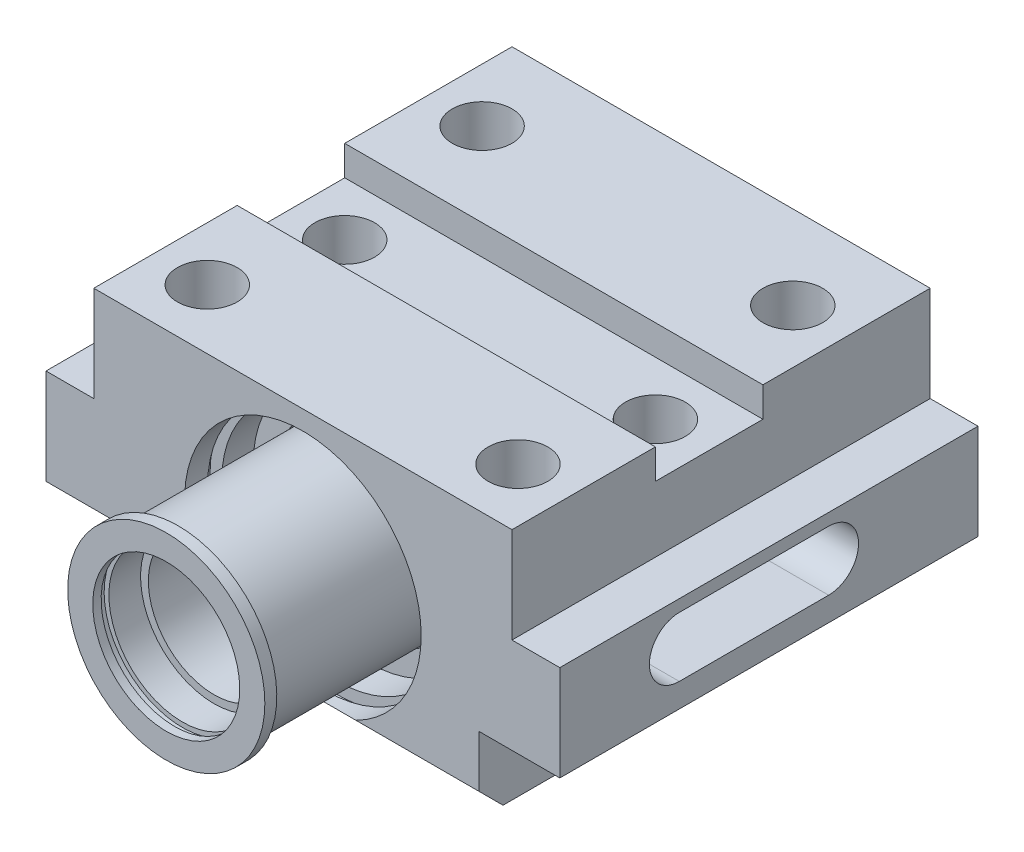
ISO-10303-21;
HEADER;
FILE_DESCRIPTION(('STEP AP214'),'2;1');
FILE_NAME('part.step','',(''),(''),'','','');
FILE_SCHEMA(('AUTOMOTIVE_DESIGN { 1 0 10303 214 1 1 1 1 }'));
ENDSEC;
DATA;
#1=APPLICATION_CONTEXT('core data for automotive mechanical design processes');
#2=APPLICATION_PROTOCOL_DEFINITION('international standard','automotive_design',2000,#1);
#3=PRODUCT_CONTEXT('',#1,'mechanical');
#4=PRODUCT('Part','Part','',(#3));
#5=PRODUCT_RELATED_PRODUCT_CATEGORY('part','',(#4));
#6=PRODUCT_DEFINITION_FORMATION('','',#4);
#7=PRODUCT_DEFINITION_CONTEXT('part definition',#1,'design');
#8=PRODUCT_DEFINITION('design','',#6,#7);
#9=PRODUCT_DEFINITION_SHAPE('','',#8);
#10=(LENGTH_UNIT() NAMED_UNIT(*) SI_UNIT(.MILLI.,.METRE.));
#11=(NAMED_UNIT(*) PLANE_ANGLE_UNIT() SI_UNIT($,.RADIAN.));
#12=(NAMED_UNIT(*) SI_UNIT($,.STERADIAN.) SOLID_ANGLE_UNIT());
#13=UNCERTAINTY_MEASURE_WITH_UNIT(LENGTH_MEASURE(1.E-05),#10,'distance_accuracy_value','');
#14=(GEOMETRIC_REPRESENTATION_CONTEXT(3) GLOBAL_UNCERTAINTY_ASSIGNED_CONTEXT((#13)) GLOBAL_UNIT_ASSIGNED_CONTEXT((#10,
#11,#12)) REPRESENTATION_CONTEXT('',''));
#15=CARTESIAN_POINT('',(0.,0.,0.));
#16=DIRECTION('',(0.,0.,1.));
#17=DIRECTION('',(1.,0.,0.));
#18=AXIS2_PLACEMENT_3D('',#15,#16,#17);
#19=CARTESIAN_POINT('',(0.,-23.,-35.));
#20=DIRECTION('',(0.,0.,1.));
#21=DIRECTION('',(1.,0.,0.));
#22=AXIS2_PLACEMENT_3D('',#19,#20,#21);
#23=CYLINDRICAL_SURFACE('',#22,15.5);
#24=CARTESIAN_POINT('',(0.,-23.,-0.629544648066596));
#25=DIRECTION('',(0.,0.,1.));
#26=DIRECTION('',(0.,-1.,0.));
#27=AXIS2_PLACEMENT_3D('',#24,#25,#26);
#28=CIRCLE('',#27,15.5);
#29=CARTESIAN_POINT('',(0.,-38.5,-0.62954464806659));
#30=VERTEX_POINT('',#29);
#31=EDGE_CURVE('E21',#30,#30,#28,.T.);
#32=ORIENTED_EDGE('',*,*,#31,.T.);
#33=EDGE_LOOP('',(#32));
#34=FACE_BOUND('',#33,.T.);
#35=CARTESIAN_POINT('',(0.,-23.,-26.));
#36=DIRECTION('',(0.,0.,-1.));
#37=DIRECTION('',(-1.,0.,0.));
#38=AXIS2_PLACEMENT_3D('',#35,#36,#37);
#39=CIRCLE('',#38,15.5);
#40=CARTESIAN_POINT('',(-15.5,-23.,-26.));
#41=VERTEX_POINT('',#40);
#42=EDGE_CURVE('E679',#41,#41,#39,.T.);
#43=ORIENTED_EDGE('',*,*,#42,.T.);
#44=EDGE_LOOP('',(#43));
#45=FACE_BOUND('',#44,.T.);
#46=ADVANCED_FACE('F17',(#34,#45),#23,.F.);
#47=CARTESIAN_POINT('',(-35.,0.,35.));
#48=DIRECTION('',(0.,-1.,0.));
#49=DIRECTION('',(1.,0.,0.));
#50=AXIS2_PLACEMENT_3D('',#47,#48,#49);
#51=PLANE('',#50);
#52=CARTESIAN_POINT('',(26.,0.,-21.0000000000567));
#53=DIRECTION('',(0.,1.,0.));
#54=DIRECTION('',(-1.,0.,0.));
#55=AXIS2_PLACEMENT_3D('',#52,#53,#54);
#56=CIRCLE('',#55,5.);
#57=CARTESIAN_POINT('',(21.,0.,-21.0000000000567));
#58=VERTEX_POINT('',#57);
#59=EDGE_CURVE('E710',#58,#58,#56,.T.);
#60=ORIENTED_EDGE('',*,*,#59,.F.);
#61=EDGE_LOOP('',(#60));
#62=FACE_BOUND('',#61,.T.);
#63=CARTESIAN_POINT('',(-26.,0.,-21.0000000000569));
#64=DIRECTION('',(0.,1.,0.));
#65=DIRECTION('',(-1.,0.,0.));
#66=AXIS2_PLACEMENT_3D('',#63,#64,#65);
#67=CIRCLE('',#66,5.);
#68=CARTESIAN_POINT('',(-31.,0.,-21.0000000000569));
#69=VERTEX_POINT('',#68);
#70=EDGE_CURVE('E709',#69,#69,#67,.T.);
#71=ORIENTED_EDGE('',*,*,#70,.F.);
#72=EDGE_LOOP('',(#71));
#73=FACE_BOUND('',#72,.T.);
#74=DIRECTION('',(0.,0.,-1.));
#75=VECTOR('',#74,1.);
#76=CARTESIAN_POINT('',(35.,0.,35.));
#77=LINE('',#76,#75);
#78=CARTESIAN_POINT('',(35.,1.11022302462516E-13,-35.));
#79=VERTEX_POINT('',#78);
#80=CARTESIAN_POINT('',(35.,1.11022302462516E-13,-7.));
#81=VERTEX_POINT('',#80);
#82=EDGE_CURVE('E410',#79,#81,#77,.F.);
#83=ORIENTED_EDGE('',*,*,#82,.F.);
#84=DIRECTION('',(1.,0.,0.));
#85=VECTOR('',#84,1.);
#86=CARTESIAN_POINT('',(-35.,1.11022302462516E-13,-35.));
#87=LINE('',#86,#85);
#88=CARTESIAN_POINT('',(-35.,1.11022302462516E-13,-35.));
#89=VERTEX_POINT('',#88);
#90=EDGE_CURVE('E646',#89,#79,#87,.T.);
#91=ORIENTED_EDGE('',*,*,#90,.F.);
#92=DIRECTION('',(0.,0.,-1.));
#93=VECTOR('',#92,1.);
#94=CARTESIAN_POINT('',(-35.,0.,35.));
#95=LINE('',#94,#93);
#96=CARTESIAN_POINT('',(-35.,1.11022302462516E-13,-7.));
#97=VERTEX_POINT('',#96);
#98=EDGE_CURVE('E441',#89,#97,#95,.F.);
#99=ORIENTED_EDGE('',*,*,#98,.T.);
#100=DIRECTION('',(-1.,0.,0.));
#101=VECTOR('',#100,1.);
#102=CARTESIAN_POINT('',(-35.,1.11022302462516E-13,-7.));
#103=LINE('',#102,#101);
#104=EDGE_CURVE('E641',#97,#81,#103,.F.);
#105=ORIENTED_EDGE('',*,*,#104,.T.);
#106=EDGE_LOOP('',(#83,#91,#99,#105));
#107=FACE_BOUND('',#106,.T.);
#108=ADVANCED_FACE('F784',(#62,#73,#107),#51,.F.);
#109=CARTESIAN_POINT('',(0.,-4.99999999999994,0.));
#110=DIRECTION('',(0.,-1.,0.));
#111=DIRECTION('',(0.,0.,-1.));
#112=AXIS2_PLACEMENT_3D('',#109,#110,#111);
#113=PLANE('',#112);
#114=CARTESIAN_POINT('',(-26.,-4.99999999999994,1.99999999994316));
#115=DIRECTION('',(0.,1.,0.));
#116=DIRECTION('',(0.,0.,1.));
#117=AXIS2_PLACEMENT_3D('',#114,#115,#116);
#118=CIRCLE('',#117,5.);
#119=CARTESIAN_POINT('',(-26.,-4.99999999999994,6.99999999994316));
#120=VERTEX_POINT('',#119);
#121=EDGE_CURVE('E1587',#120,#120,#118,.T.);
#122=ORIENTED_EDGE('',*,*,#121,.F.);
#123=EDGE_LOOP('',(#122));
#124=FACE_BOUND('',#123,.T.);
#125=CARTESIAN_POINT('',(26.,-4.99999999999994,1.99999999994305));
#126=DIRECTION('',(0.,1.,0.));
#127=DIRECTION('',(0.,0.,1.));
#128=AXIS2_PLACEMENT_3D('',#125,#126,#127);
#129=CIRCLE('',#128,5.);
#130=CARTESIAN_POINT('',(26.,-4.99999999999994,6.99999999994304));
#131=VERTEX_POINT('',#130);
#132=EDGE_CURVE('E1584',#131,#131,#129,.T.);
#133=ORIENTED_EDGE('',*,*,#132,.F.);
#134=EDGE_LOOP('',(#133));
#135=FACE_BOUND('',#134,.T.);
#136=DIRECTION('',(0.,0.,1.));
#137=VECTOR('',#136,1.);
#138=CARTESIAN_POINT('',(35.,-5.,35.));
#139=LINE('',#138,#137);
#140=CARTESIAN_POINT('',(35.,-5.,11.));
#141=VERTEX_POINT('',#140);
#142=CARTESIAN_POINT('',(35.,-5.,-7.));
#143=VERTEX_POINT('',#142);
#144=EDGE_CURVE('E307',#141,#143,#139,.F.);
#145=ORIENTED_EDGE('',*,*,#144,.T.);
#146=DIRECTION('',(1.,0.,0.));
#147=VECTOR('',#146,1.);
#148=CARTESIAN_POINT('',(0.,-5.,-7.));
#149=LINE('',#148,#147);
#150=CARTESIAN_POINT('',(-35.,-5.,-7.));
#151=VERTEX_POINT('',#150);
#152=EDGE_CURVE('E337',#151,#143,#149,.T.);
#153=ORIENTED_EDGE('',*,*,#152,.F.);
#154=DIRECTION('',(0.,0.,-1.));
#155=VECTOR('',#154,1.);
#156=CARTESIAN_POINT('',(-35.,-5.,35.));
#157=LINE('',#156,#155);
#158=CARTESIAN_POINT('',(-35.,-5.,11.));
#159=VERTEX_POINT('',#158);
#160=EDGE_CURVE('E312',#151,#159,#157,.F.);
#161=ORIENTED_EDGE('',*,*,#160,.T.);
#162=DIRECTION('',(1.,0.,0.));
#163=VECTOR('',#162,1.);
#164=CARTESIAN_POINT('',(0.,-5.,11.));
#165=LINE('',#164,#163);
#166=EDGE_CURVE('E335',#141,#159,#165,.F.);
#167=ORIENTED_EDGE('',*,*,#166,.F.);
#168=EDGE_LOOP('',(#145,#153,#161,#167));
#169=FACE_BOUND('',#168,.T.);
#170=ADVANCED_FACE('F790',(#124,#135,#169),#113,.F.);
#171=CARTESIAN_POINT('',(-35.,0.,35.));
#172=DIRECTION('',(0.,-1.,0.));
#173=DIRECTION('',(1.,0.,0.));
#174=AXIS2_PLACEMENT_3D('',#171,#172,#173);
#175=PLANE('',#174);
#176=CARTESIAN_POINT('',(26.,0.,24.9999999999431));
#177=DIRECTION('',(0.,1.,0.));
#178=DIRECTION('',(-1.,0.,0.));
#179=AXIS2_PLACEMENT_3D('',#176,#177,#178);
#180=CIRCLE('',#179,5.);
#181=CARTESIAN_POINT('',(21.,0.,24.9999999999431));
#182=VERTEX_POINT('',#181);
#183=EDGE_CURVE('E1581',#182,#182,#180,.T.);
#184=ORIENTED_EDGE('',*,*,#183,.F.);
#185=EDGE_LOOP('',(#184));
#186=FACE_BOUND('',#185,.T.);
#187=CARTESIAN_POINT('',(-26.,0.,24.9999999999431));
#188=DIRECTION('',(0.,1.,0.));
#189=DIRECTION('',(-1.,0.,0.));
#190=AXIS2_PLACEMENT_3D('',#187,#188,#189);
#191=CIRCLE('',#190,5.);
#192=CARTESIAN_POINT('',(-31.,0.,24.9999999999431));
#193=VERTEX_POINT('',#192);
#194=EDGE_CURVE('E1579',#193,#193,#191,.T.);
#195=ORIENTED_EDGE('',*,*,#194,.F.);
#196=EDGE_LOOP('',(#195));
#197=FACE_BOUND('',#196,.T.);
#198=DIRECTION('',(0.,0.,-1.));
#199=VECTOR('',#198,1.);
#200=CARTESIAN_POINT('',(-35.,0.,35.));
#201=LINE('',#200,#199);
#202=CARTESIAN_POINT('',(-35.,0.,11.));
#203=VERTEX_POINT('',#202);
#204=CARTESIAN_POINT('',(-35.,0.,35.));
#205=VERTEX_POINT('',#204);
#206=EDGE_CURVE('E437',#203,#205,#201,.F.);
#207=ORIENTED_EDGE('',*,*,#206,.T.);
#208=DIRECTION('',(1.,0.,0.));
#209=VECTOR('',#208,1.);
#210=CARTESIAN_POINT('',(-35.,0.,35.));
#211=LINE('',#210,#209);
#212=CARTESIAN_POINT('',(35.,0.,35.));
#213=VERTEX_POINT('',#212);
#214=EDGE_CURVE('E596',#213,#205,#211,.F.);
#215=ORIENTED_EDGE('',*,*,#214,.F.);
#216=DIRECTION('',(0.,0.,-1.));
#217=VECTOR('',#216,1.);
#218=CARTESIAN_POINT('',(35.,0.,35.));
#219=LINE('',#218,#217);
#220=CARTESIAN_POINT('',(35.,0.,11.));
#221=VERTEX_POINT('',#220);
#222=EDGE_CURVE('E469',#221,#213,#219,.F.);
#223=ORIENTED_EDGE('',*,*,#222,.F.);
#224=DIRECTION('',(1.,0.,0.));
#225=VECTOR('',#224,1.);
#226=CARTESIAN_POINT('',(-35.,0.,11.));
#227=LINE('',#226,#225);
#228=EDGE_CURVE('E636',#221,#203,#227,.F.);
#229=ORIENTED_EDGE('',*,*,#228,.T.);
#230=EDGE_LOOP('',(#207,#215,#223,#229));
#231=FACE_BOUND('',#230,.T.);
#232=ADVANCED_FACE('F896',(#186,#197,#231),#175,.F.);
#233=CARTESIAN_POINT('',(43.,-16.,35.));
#234=DIRECTION('',(-1.,0.,0.));
#235=DIRECTION('',(0.,0.,1.));
#236=AXIS2_PLACEMENT_3D('',#233,#234,#235);
#237=PLANE('',#236);
#238=DIRECTION('',(0.,0.,-1.));
#239=VECTOR('',#238,1.);
#240=CARTESIAN_POINT('',(43.,-32.,35.));
#241=LINE('',#240,#239);
#242=CARTESIAN_POINT('',(43.,-32.,-35.));
#243=VERTEX_POINT('',#242);
#244=CARTESIAN_POINT('',(43.,-32.,35.));
#245=VERTEX_POINT('',#244);
#246=EDGE_CURVE('E418',#243,#245,#241,.F.);
#247=ORIENTED_EDGE('',*,*,#246,.F.);
#248=DIRECTION('',(0.,-1.,0.));
#249=VECTOR('',#248,1.);
#250=CARTESIAN_POINT('',(43.,-16.,-35.));
#251=LINE('',#250,#249);
#252=CARTESIAN_POINT('',(43.,-16.,-35.));
#253=VERTEX_POINT('',#252);
#254=EDGE_CURVE('E517',#253,#243,#251,.T.);
#255=ORIENTED_EDGE('',*,*,#254,.F.);
#256=DIRECTION('',(0.,0.,1.));
#257=VECTOR('',#256,1.);
#258=CARTESIAN_POINT('',(43.,-16.,35.));
#259=LINE('',#258,#257);
#260=CARTESIAN_POINT('',(43.,-16.,35.));
#261=VERTEX_POINT('',#260);
#262=EDGE_CURVE('E413',#261,#253,#259,.F.);
#263=ORIENTED_EDGE('',*,*,#262,.F.);
#264=DIRECTION('',(0.,-1.,0.));
#265=VECTOR('',#264,1.);
#266=CARTESIAN_POINT('',(43.,-16.,35.));
#267=LINE('',#266,#265);
#268=EDGE_CURVE('E484',#245,#261,#267,.F.);
#269=ORIENTED_EDGE('',*,*,#268,.F.);
#270=EDGE_LOOP('',(#247,#255,#263,#269));
#271=FACE_BOUND('',#270,.T.);
#272=CARTESIAN_POINT('',(43.,-23.,-10.));
#273=DIRECTION('',(-1.,0.,0.));
#274=DIRECTION('',(0.,0.,1.));
#275=AXIS2_PLACEMENT_3D('',#272,#273,#274);
#276=CIRCLE('',#275,5.);
#277=CARTESIAN_POINT('',(43.,-18.,-10.));
#278=VERTEX_POINT('',#277);
#279=CARTESIAN_POINT('',(43.,-28.,-10.));
#280=VERTEX_POINT('',#279);
#281=EDGE_CURVE('E671',#278,#280,#276,.T.);
#282=ORIENTED_EDGE('',*,*,#281,.T.);
#283=DIRECTION('',(0.,0.,1.));
#284=VECTOR('',#283,1.);
#285=CARTESIAN_POINT('',(43.,-28.,35.));
#286=LINE('',#285,#284);
#287=CARTESIAN_POINT('',(43.,-28.,15.));
#288=VERTEX_POINT('',#287);
#289=EDGE_CURVE('E674',#280,#288,#286,.T.);
#290=ORIENTED_EDGE('',*,*,#289,.T.);
#291=CARTESIAN_POINT('',(43.,-23.,15.));
#292=DIRECTION('',(-1.,0.,0.));
#293=DIRECTION('',(0.,0.,1.));
#294=AXIS2_PLACEMENT_3D('',#291,#292,#293);
#295=CIRCLE('',#294,5.);
#296=CARTESIAN_POINT('',(43.,-18.,15.));
#297=VERTEX_POINT('',#296);
#298=EDGE_CURVE('E665',#288,#297,#295,.T.);
#299=ORIENTED_EDGE('',*,*,#298,.T.);
#300=DIRECTION('',(0.,0.,-1.));
#301=VECTOR('',#300,1.);
#302=CARTESIAN_POINT('',(43.,-18.,35.));
#303=LINE('',#302,#301);
#304=EDGE_CURVE('E668',#297,#278,#303,.T.);
#305=ORIENTED_EDGE('',*,*,#304,.T.);
#306=EDGE_LOOP('',(#282,#290,#299,#305));
#307=FACE_BOUND('',#306,.T.);
#308=ADVANCED_FACE('F893',(#271,#307),#237,.F.);
#309=CARTESIAN_POINT('',(-43.,-32.,35.));
#310=DIRECTION('',(1.,0.,0.));
#311=DIRECTION('',(0.,0.,-1.));
#312=AXIS2_PLACEMENT_3D('',#309,#310,#311);
#313=PLANE('',#312);
#314=DIRECTION('',(0.,0.,1.));
#315=VECTOR('',#314,1.);
#316=CARTESIAN_POINT('',(-43.,-16.,35.));
#317=LINE('',#316,#315);
#318=CARTESIAN_POINT('',(-43.,-16.,35.));
#319=VERTEX_POINT('',#318);
#320=CARTESIAN_POINT('',(-43.,-16.,-35.));
#321=VERTEX_POINT('',#320);
#322=EDGE_CURVE('E446',#319,#321,#317,.F.);
#323=ORIENTED_EDGE('',*,*,#322,.T.);
#324=DIRECTION('',(0.,1.,0.));
#325=VECTOR('',#324,1.);
#326=CARTESIAN_POINT('',(-43.,-32.,-35.));
#327=LINE('',#326,#325);
#328=CARTESIAN_POINT('',(-43.,-32.,-35.));
#329=VERTEX_POINT('',#328);
#330=EDGE_CURVE('E497',#329,#321,#327,.T.);
#331=ORIENTED_EDGE('',*,*,#330,.F.);
#332=DIRECTION('',(0.,0.,-1.));
#333=VECTOR('',#332,1.);
#334=CARTESIAN_POINT('',(-43.,-32.,35.));
#335=LINE('',#334,#333);
#336=CARTESIAN_POINT('',(-43.,-32.,35.));
#337=VERTEX_POINT('',#336);
#338=EDGE_CURVE('E451',#329,#337,#335,.F.);
#339=ORIENTED_EDGE('',*,*,#338,.T.);
#340=DIRECTION('',(0.,1.,0.));
#341=VECTOR('',#340,1.);
#342=CARTESIAN_POINT('',(-43.,-32.,35.));
#343=LINE('',#342,#341);
#344=EDGE_CURVE('E549',#319,#337,#343,.F.);
#345=ORIENTED_EDGE('',*,*,#344,.F.);
#346=EDGE_LOOP('',(#323,#331,#339,#345));
#347=FACE_BOUND('',#346,.T.);
#348=DIRECTION('',(0.,0.,-1.));
#349=VECTOR('',#348,1.);
#350=CARTESIAN_POINT('',(-43.,-28.,35.));
#351=LINE('',#350,#349);
#352=CARTESIAN_POINT('',(-43.,-28.,15.));
#353=VERTEX_POINT('',#352);
#354=CARTESIAN_POINT('',(-43.,-28.,-10.));
#355=VERTEX_POINT('',#354);
#356=EDGE_CURVE('E659',#353,#355,#351,.T.);
#357=ORIENTED_EDGE('',*,*,#356,.T.);
#358=CARTESIAN_POINT('',(-43.,-23.,-10.));
#359=DIRECTION('',(1.,0.,0.));
#360=DIRECTION('',(0.,0.,-1.));
#361=AXIS2_PLACEMENT_3D('',#358,#359,#360);
#362=CIRCLE('',#361,5.);
#363=CARTESIAN_POINT('',(-43.,-18.,-10.));
#364=VERTEX_POINT('',#363);
#365=EDGE_CURVE('E662',#355,#364,#362,.T.);
#366=ORIENTED_EDGE('',*,*,#365,.T.);
#367=DIRECTION('',(0.,0.,1.));
#368=VECTOR('',#367,1.);
#369=CARTESIAN_POINT('',(-43.,-18.,35.));
#370=LINE('',#369,#368);
#371=CARTESIAN_POINT('',(-43.,-18.,15.));
#372=VERTEX_POINT('',#371);
#373=EDGE_CURVE('E651',#364,#372,#370,.T.);
#374=ORIENTED_EDGE('',*,*,#373,.T.);
#375=CARTESIAN_POINT('',(-43.,-23.,15.));
#376=DIRECTION('',(1.,0.,0.));
#377=DIRECTION('',(0.,0.,-1.));
#378=AXIS2_PLACEMENT_3D('',#375,#376,#377);
#379=CIRCLE('',#378,5.);
#380=EDGE_CURVE('E656',#372,#353,#379,.T.);
#381=ORIENTED_EDGE('',*,*,#380,.T.);
#382=EDGE_LOOP('',(#357,#366,#374,#381));
#383=FACE_BOUND('',#382,.T.);
#384=ADVANCED_FACE('F813',(#347,#383),#313,.F.);
#385=CARTESIAN_POINT('',(0.,-23.,24.));
#386=DIRECTION('',(0.,0.,1.));
#387=DIRECTION('',(1.,0.,0.));
#388=AXIS2_PLACEMENT_3D('',#385,#386,#387);
#389=PLANE('',#388);
#390=CARTESIAN_POINT('',(0.,-23.,24.));
#391=DIRECTION('',(0.,0.,1.));
#392=DIRECTION('',(1.,0.,0.));
#393=AXIS2_PLACEMENT_3D('',#390,#391,#392);
#394=CIRCLE('',#393,15.5);
#395=CARTESIAN_POINT('',(15.5,-23.,24.));
#396=VERTEX_POINT('',#395);
#397=EDGE_CURVE('E26',#396,#396,#394,.T.);
#398=ORIENTED_EDGE('',*,*,#397,.F.);
#399=EDGE_LOOP('',(#398));
#400=FACE_BOUND('',#399,.T.);
#401=CARTESIAN_POINT('',(0.,-23.,24.));
#402=DIRECTION('',(0.,0.,1.));
#403=DIRECTION('',(1.,0.,0.));
#404=AXIS2_PLACEMENT_3D('',#401,#402,#403);
#405=CIRCLE('',#404,19.3);
#406=CARTESIAN_POINT('',(19.3,-23.,24.));
#407=VERTEX_POINT('',#406);
#408=EDGE_CURVE('E397',#407,#407,#405,.T.);
#409=ORIENTED_EDGE('',*,*,#408,.T.);
#410=EDGE_LOOP('',(#409));
#411=FACE_BOUND('',#410,.T.);
#412=ADVANCED_FACE('F809',(#400,#411),#389,.T.);
#413=CARTESIAN_POINT('',(0.,-23.,-32.0028570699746));
#414=DIRECTION('',(0.,0.,1.));
#415=DIRECTION('',(1.,0.,0.));
#416=AXIS2_PLACEMENT_3D('',#413,#414,#415);
#417=CYLINDRICAL_SURFACE('',#416,19.3);
#418=CARTESIAN_POINT('',(0.,-23.,29.3));
#419=DIRECTION('',(0.,0.,1.));
#420=DIRECTION('',(1.,0.,0.));
#421=AXIS2_PLACEMENT_3D('',#418,#419,#420);
#422=CIRCLE('',#421,19.3);
#423=CARTESIAN_POINT('',(19.3,-23.,29.3));
#424=VERTEX_POINT('',#423);
#425=EDGE_CURVE('E338',#424,#424,#422,.F.);
#426=ORIENTED_EDGE('',*,*,#425,.F.);
#427=EDGE_LOOP('',(#426));
#428=FACE_BOUND('',#427,.T.);
#429=ORIENTED_EDGE('',*,*,#408,.F.);
#430=EDGE_LOOP('',(#429));
#431=FACE_BOUND('',#430,.T.);
#432=ADVANCED_FACE('F812',(#428,#431),#417,.F.);
#433=CARTESIAN_POINT('',(-35.,-5.,-7.));
#434=DIRECTION('',(0.,0.,-1.));
#435=DIRECTION('',(-1.,0.,0.));
#436=AXIS2_PLACEMENT_3D('',#433,#434,#435);
#437=PLANE('',#436);
#438=DIRECTION('',(0.,-1.,0.));
#439=VECTOR('',#438,1.);
#440=CARTESIAN_POINT('',(35.,1.11022302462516E-13,-7.));
#441=LINE('',#440,#439);
#442=EDGE_CURVE('E530',#143,#81,#441,.F.);
#443=ORIENTED_EDGE('',*,*,#442,.T.);
#444=ORIENTED_EDGE('',*,*,#104,.F.);
#445=DIRECTION('',(0.,-1.,0.));
#446=VECTOR('',#445,1.);
#447=CARTESIAN_POINT('',(-35.,-5.,-7.));
#448=LINE('',#447,#446);
#449=EDGE_CURVE('E536',#151,#97,#448,.F.);
#450=ORIENTED_EDGE('',*,*,#449,.F.);
#451=ORIENTED_EDGE('',*,*,#152,.T.);
#452=EDGE_LOOP('',(#443,#444,#450,#451));
#453=FACE_BOUND('',#452,.T.);
#454=ADVANCED_FACE('F819',(#453),#437,.F.);
#455=CARTESIAN_POINT('',(-35.,-5.,11.));
#456=DIRECTION('',(0.,0.,1.));
#457=DIRECTION('',(1.,0.,0.));
#458=AXIS2_PLACEMENT_3D('',#455,#456,#457);
#459=PLANE('',#458);
#460=DIRECTION('',(0.,-1.,0.));
#461=VECTOR('',#460,1.);
#462=CARTESIAN_POINT('',(-35.,-16.,11.));
#463=LINE('',#462,#461);
#464=EDGE_CURVE('E532',#159,#203,#463,.F.);
#465=ORIENTED_EDGE('',*,*,#464,.T.);
#466=ORIENTED_EDGE('',*,*,#228,.F.);
#467=DIRECTION('',(0.,-1.,0.));
#468=VECTOR('',#467,1.);
#469=CARTESIAN_POINT('',(35.,-5.,11.));
#470=LINE('',#469,#468);
#471=EDGE_CURVE('E526',#141,#221,#470,.F.);
#472=ORIENTED_EDGE('',*,*,#471,.F.);
#473=ORIENTED_EDGE('',*,*,#166,.T.);
#474=EDGE_LOOP('',(#465,#466,#472,#473));
#475=FACE_BOUND('',#474,.T.);
#476=ADVANCED_FACE('F777',(#475),#459,.F.);
#477=CARTESIAN_POINT('',(0.,-23.,29.3));
#478=DIRECTION('',(0.,0.,1.));
#479=DIRECTION('',(1.,0.,0.));
#480=AXIS2_PLACEMENT_3D('',#477,#478,#479);
#481=PLANE('',#480);
#482=ORIENTED_EDGE('',*,*,#425,.T.);
#483=EDGE_LOOP('',(#482));
#484=FACE_BOUND('',#483,.T.);
#485=CARTESIAN_POINT('',(0.,-23.,29.3));
#486=DIRECTION('',(0.,0.,-1.));
#487=DIRECTION('',(-1.,0.,0.));
#488=AXIS2_PLACEMENT_3D('',#485,#486,#487);
#489=CIRCLE('',#488,21.25);
#490=CARTESIAN_POINT('',(-21.25,-23.,29.3));
#491=VERTEX_POINT('',#490);
#492=EDGE_CURVE('E313',#491,#491,#489,.F.);
#493=ORIENTED_EDGE('',*,*,#492,.T.);
#494=EDGE_LOOP('',(#493));
#495=FACE_BOUND('',#494,.T.);
#496=ADVANCED_FACE('F765',(#484,#495),#481,.T.);
#497=CARTESIAN_POINT('',(0.,-23.,31.15));
#498=DIRECTION('',(0.,0.,-1.));
#499=DIRECTION('',(-1.,0.,0.));
#500=AXIS2_PLACEMENT_3D('',#497,#498,#499);
#501=CYLINDRICAL_SURFACE('',#500,21.25);
#502=ORIENTED_EDGE('',*,*,#492,.F.);
#503=EDGE_LOOP('',(#502));
#504=FACE_BOUND('',#503,.T.);
#505=CARTESIAN_POINT('',(0.,-23.,31.15));
#506=DIRECTION('',(0.,0.,-1.));
#507=DIRECTION('',(-1.,0.,0.));
#508=AXIS2_PLACEMENT_3D('',#505,#506,#507);
#509=CIRCLE('',#508,21.25);
#510=CARTESIAN_POINT('',(-21.25,-23.,31.15));
#511=VERTEX_POINT('',#510);
#512=EDGE_CURVE('E284',#511,#511,#509,.F.);
#513=ORIENTED_EDGE('',*,*,#512,.T.);
#514=EDGE_LOOP('',(#513));
#515=FACE_BOUND('',#514,.T.);
#516=ADVANCED_FACE('F762',(#504,#515),#501,.F.);
#517=CARTESIAN_POINT('',(-43.,-16.,35.));
#518=DIRECTION('',(0.,-1.,0.));
#519=DIRECTION('',(0.,0.,-1.));
#520=AXIS2_PLACEMENT_3D('',#517,#518,#519);
#521=PLANE('',#520);
#522=ORIENTED_EDGE('',*,*,#322,.F.);
#523=DIRECTION('',(1.,0.,0.));
#524=VECTOR('',#523,1.);
#525=CARTESIAN_POINT('',(-43.,-16.,35.));
#526=LINE('',#525,#524);
#527=CARTESIAN_POINT('',(-35.,-16.,35.));
#528=VERTEX_POINT('',#527);
#529=EDGE_CURVE('E591',#528,#319,#526,.F.);
#530=ORIENTED_EDGE('',*,*,#529,.F.);
#531=DIRECTION('',(0.,0.,-1.));
#532=VECTOR('',#531,1.);
#533=CARTESIAN_POINT('',(-35.,-16.,35.));
#534=LINE('',#533,#532);
#535=CARTESIAN_POINT('',(-35.,-16.,-35.));
#536=VERTEX_POINT('',#535);
#537=EDGE_CURVE('E310',#528,#536,#534,.T.);
#538=ORIENTED_EDGE('',*,*,#537,.T.);
#539=DIRECTION('',(-1.,0.,0.));
#540=VECTOR('',#539,1.);
#541=CARTESIAN_POINT('',(0.,-16.,-35.));
#542=LINE('',#541,#540);
#543=EDGE_CURVE('E553',#536,#321,#542,.T.);
#544=ORIENTED_EDGE('',*,*,#543,.T.);
#545=EDGE_LOOP('',(#522,#530,#538,#544));
#546=FACE_BOUND('',#545,.T.);
#547=ADVANCED_FACE('F764',(#546),#521,.F.);
#548=CARTESIAN_POINT('',(-35.,-16.,35.));
#549=DIRECTION('',(1.,0.,0.));
#550=DIRECTION('',(0.,0.,-1.));
#551=AXIS2_PLACEMENT_3D('',#548,#549,#550);
#552=PLANE('',#551);
#553=ORIENTED_EDGE('',*,*,#464,.F.);
#554=ORIENTED_EDGE('',*,*,#160,.F.);
#555=ORIENTED_EDGE('',*,*,#449,.T.);
#556=ORIENTED_EDGE('',*,*,#98,.F.);
#557=DIRECTION('',(0.,1.,0.));
#558=VECTOR('',#557,1.);
#559=CARTESIAN_POINT('',(-35.,-16.,-35.));
#560=LINE('',#559,#558);
#561=EDGE_CURVE('E492',#536,#89,#560,.T.);
#562=ORIENTED_EDGE('',*,*,#561,.F.);
#563=ORIENTED_EDGE('',*,*,#537,.F.);
#564=DIRECTION('',(0.,-1.,0.));
#565=VECTOR('',#564,1.);
#566=CARTESIAN_POINT('',(-35.,0.,35.));
#567=LINE('',#566,#565);
#568=EDGE_CURVE('E473',#528,#205,#567,.F.);
#569=ORIENTED_EDGE('',*,*,#568,.T.);
#570=ORIENTED_EDGE('',*,*,#206,.F.);
#571=EDGE_LOOP('',(#553,#554,#555,#556,#562,#563,#569,#570));
#572=FACE_BOUND('',#571,.T.);
#573=ADVANCED_FACE('F774',(#572),#552,.F.);
#574=CARTESIAN_POINT('',(35.,0.,35.));
#575=DIRECTION('',(-1.,0.,0.));
#576=DIRECTION('',(0.,0.,1.));
#577=AXIS2_PLACEMENT_3D('',#574,#575,#576);
#578=PLANE('',#577);
#579=ORIENTED_EDGE('',*,*,#144,.F.);
#580=ORIENTED_EDGE('',*,*,#471,.T.);
#581=ORIENTED_EDGE('',*,*,#222,.T.);
#582=DIRECTION('',(0.,-1.,0.));
#583=VECTOR('',#582,1.);
#584=CARTESIAN_POINT('',(35.,0.,35.));
#585=LINE('',#584,#583);
#586=CARTESIAN_POINT('',(35.,-16.,35.));
#587=VERTEX_POINT('',#586);
#588=EDGE_CURVE('E479',#587,#213,#585,.F.);
#589=ORIENTED_EDGE('',*,*,#588,.F.);
#590=DIRECTION('',(0.,0.,1.));
#591=VECTOR('',#590,1.);
#592=CARTESIAN_POINT('',(35.,-16.,35.));
#593=LINE('',#592,#591);
#594=CARTESIAN_POINT('',(35.,-16.,-35.));
#595=VERTEX_POINT('',#594);
#596=EDGE_CURVE('E305',#587,#595,#593,.F.);
#597=ORIENTED_EDGE('',*,*,#596,.T.);
#598=DIRECTION('',(0.,1.,0.));
#599=VECTOR('',#598,1.);
#600=CARTESIAN_POINT('',(35.,1.11022302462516E-13,-35.));
#601=LINE('',#600,#599);
#602=EDGE_CURVE('E521',#595,#79,#601,.T.);
#603=ORIENTED_EDGE('',*,*,#602,.T.);
#604=ORIENTED_EDGE('',*,*,#82,.T.);
#605=ORIENTED_EDGE('',*,*,#442,.F.);
#606=EDGE_LOOP('',(#579,#580,#581,#589,#597,#603,#604,#605));
#607=FACE_BOUND('',#606,.T.);
#608=ADVANCED_FACE('F915',(#607),#578,.F.);
#609=CARTESIAN_POINT('',(35.,-16.,35.));
#610=DIRECTION('',(0.,-1.,0.));
#611=DIRECTION('',(1.,0.,0.));
#612=AXIS2_PLACEMENT_3D('',#609,#610,#611);
#613=PLANE('',#612);
#614=ORIENTED_EDGE('',*,*,#262,.T.);
#615=DIRECTION('',(1.,0.,0.));
#616=VECTOR('',#615,1.);
#617=CARTESIAN_POINT('',(35.,-16.,-35.));
#618=LINE('',#617,#616);
#619=EDGE_CURVE('E558',#595,#253,#618,.T.);
#620=ORIENTED_EDGE('',*,*,#619,.F.);
#621=ORIENTED_EDGE('',*,*,#596,.F.);
#622=DIRECTION('',(-1.,0.,0.));
#623=VECTOR('',#622,1.);
#624=CARTESIAN_POINT('',(0.,-16.,35.));
#625=LINE('',#624,#623);
#626=EDGE_CURVE('E601',#587,#261,#625,.F.);
#627=ORIENTED_EDGE('',*,*,#626,.T.);
#628=EDGE_LOOP('',(#614,#620,#621,#627));
#629=FACE_BOUND('',#628,.T.);
#630=ADVANCED_FACE('F912',(#629),#613,.F.);
#631=CARTESIAN_POINT('',(0.,-43.,-21.));
#632=DIRECTION('',(0.,1.,0.));
#633=DIRECTION('',(-1.,0.,0.));
#634=AXIS2_PLACEMENT_3D('',#631,#632,#633);
#635=PLANE('',#634);
#636=DIRECTION('',(0.,0.,1.));
#637=VECTOR('',#636,1.);
#638=CARTESIAN_POINT('',(29.5,-43.,-21.));
#639=LINE('',#638,#637);
#640=CARTESIAN_POINT('',(29.5,-43.,-21.));
#641=VERTEX_POINT('',#640);
#642=CARTESIAN_POINT('',(29.5,-43.,-35.));
#643=VERTEX_POINT('',#642);
#644=EDGE_CURVE('E422',#641,#643,#639,.F.);
#645=ORIENTED_EDGE('',*,*,#644,.F.);
#646=DIRECTION('',(-1.,0.,0.));
#647=VECTOR('',#646,1.);
#648=CARTESIAN_POINT('',(0.,-43.,-21.));
#649=LINE('',#648,#647);
#650=CARTESIAN_POINT('',(19.,-43.,-21.));
#651=VERTEX_POINT('',#650);
#652=EDGE_CURVE('E282',#651,#641,#649,.F.);
#653=ORIENTED_EDGE('',*,*,#652,.F.);
#654=CARTESIAN_POINT('',(19.,-43.,-28.));
#655=DIRECTION('',(0.,1.,0.));
#656=DIRECTION('',(0.,0.,1.));
#657=AXIS2_PLACEMENT_3D('',#654,#655,#656);
#658=CIRCLE('',#657,7.);
#659=CARTESIAN_POINT('',(12.,-43.,-28.));
#660=VERTEX_POINT('',#659);
#661=EDGE_CURVE('E279',#651,#660,#658,.F.);
#662=ORIENTED_EDGE('',*,*,#661,.T.);
#663=DIRECTION('',(0.,0.,1.));
#664=VECTOR('',#663,1.);
#665=CARTESIAN_POINT('',(12.,-43.,-21.));
#666=LINE('',#665,#664);
#667=CARTESIAN_POINT('',(12.,-43.,-35.));
#668=VERTEX_POINT('',#667);
#669=EDGE_CURVE('E273',#660,#668,#666,.F.);
#670=ORIENTED_EDGE('',*,*,#669,.T.);
#671=DIRECTION('',(1.,0.,0.));
#672=VECTOR('',#671,1.);
#673=CARTESIAN_POINT('',(0.,-43.,-35.));
#674=LINE('',#673,#672);
#675=EDGE_CURVE('E571',#668,#643,#674,.T.);
#676=ORIENTED_EDGE('',*,*,#675,.T.);
#677=EDGE_LOOP('',(#645,#653,#662,#670,#676));
#678=FACE_BOUND('',#677,.T.);
#679=ADVANCED_FACE('F910',(#678),#635,.F.);
#680=CARTESIAN_POINT('',(0.,-43.,-21.));
#681=DIRECTION('',(0.,1.,0.));
#682=DIRECTION('',(0.,0.,1.));
#683=AXIS2_PLACEMENT_3D('',#680,#681,#682);
#684=PLANE('',#683);
#685=DIRECTION('',(0.,0.,1.));
#686=VECTOR('',#685,1.);
#687=CARTESIAN_POINT('',(-29.5,-43.,35.));
#688=LINE('',#687,#686);
#689=CARTESIAN_POINT('',(-29.5,-43.,-21.));
#690=VERTEX_POINT('',#689);
#691=CARTESIAN_POINT('',(-29.5,-43.,-35.));
#692=VERTEX_POINT('',#691);
#693=EDGE_CURVE('E456',#690,#692,#688,.F.);
#694=ORIENTED_EDGE('',*,*,#693,.T.);
#695=DIRECTION('',(-1.,0.,0.));
#696=VECTOR('',#695,1.);
#697=CARTESIAN_POINT('',(0.,-43.,-35.));
#698=LINE('',#697,#696);
#699=CARTESIAN_POINT('',(-12.,-43.,-35.));
#700=VERTEX_POINT('',#699);
#701=EDGE_CURVE('E254',#700,#692,#698,.T.);
#702=ORIENTED_EDGE('',*,*,#701,.F.);
#703=DIRECTION('',(0.,0.,1.));
#704=VECTOR('',#703,1.);
#705=CARTESIAN_POINT('',(-12.,-43.,-21.));
#706=LINE('',#705,#704);
#707=CARTESIAN_POINT('',(-12.,-43.,-28.));
#708=VERTEX_POINT('',#707);
#709=EDGE_CURVE('E248',#708,#700,#706,.F.);
#710=ORIENTED_EDGE('',*,*,#709,.F.);
#711=CARTESIAN_POINT('',(-19.,-43.,-28.));
#712=DIRECTION('',(0.,-1.,0.));
#713=DIRECTION('',(0.,0.,-1.));
#714=AXIS2_PLACEMENT_3D('',#711,#712,#713);
#715=CIRCLE('',#714,7.);
#716=CARTESIAN_POINT('',(-19.,-43.,-21.));
#717=VERTEX_POINT('',#716);
#718=EDGE_CURVE('E238',#708,#717,#715,.T.);
#719=ORIENTED_EDGE('',*,*,#718,.T.);
#720=DIRECTION('',(-1.,0.,0.));
#721=VECTOR('',#720,1.);
#722=CARTESIAN_POINT('',(0.,-43.,-21.));
#723=LINE('',#722,#721);
#724=EDGE_CURVE('E264',#690,#717,#723,.F.);
#725=ORIENTED_EDGE('',*,*,#724,.F.);
#726=EDGE_LOOP('',(#694,#702,#710,#719,#725));
#727=FACE_BOUND('',#726,.T.);
#728=ADVANCED_FACE('F252',(#727),#684,.F.);
#729=CARTESIAN_POINT('',(-29.5,-32.,35.));
#730=DIRECTION('',(0.,1.,0.));
#731=DIRECTION('',(-1.,0.,0.));
#732=AXIS2_PLACEMENT_3D('',#729,#730,#731);
#733=PLANE('',#732);
#734=ORIENTED_EDGE('',*,*,#338,.F.);
#735=DIRECTION('',(-1.,0.,0.));
#736=VECTOR('',#735,1.);
#737=CARTESIAN_POINT('',(-29.5,-32.,-35.));
#738=LINE('',#737,#736);
#739=CARTESIAN_POINT('',(-29.5,-32.,-35.));
#740=VERTEX_POINT('',#739);
#741=EDGE_CURVE('E563',#740,#329,#738,.T.);
#742=ORIENTED_EDGE('',*,*,#741,.F.);
#743=DIRECTION('',(0.,0.,1.));
#744=VECTOR('',#743,1.);
#745=CARTESIAN_POINT('',(-29.5,-32.,35.));
#746=LINE('',#745,#744);
#747=CARTESIAN_POINT('',(-29.5,-32.,35.));
#748=VERTEX_POINT('',#747);
#749=EDGE_CURVE('E293',#740,#748,#746,.T.);
#750=ORIENTED_EDGE('',*,*,#749,.T.);
#751=DIRECTION('',(1.,0.,0.));
#752=VECTOR('',#751,1.);
#753=CARTESIAN_POINT('',(0.,-32.,35.));
#754=LINE('',#753,#752);
#755=EDGE_CURVE('E581',#748,#337,#754,.F.);
#756=ORIENTED_EDGE('',*,*,#755,.T.);
#757=EDGE_LOOP('',(#734,#742,#750,#756));
#758=FACE_BOUND('',#757,.T.);
#759=ADVANCED_FACE('F758',(#758),#733,.F.);
#760=CARTESIAN_POINT('',(0.,-23.,31.15));
#761=DIRECTION('',(0.,0.,1.));
#762=DIRECTION('',(1.,0.,0.));
#763=AXIS2_PLACEMENT_3D('',#760,#761,#762);
#764=PLANE('',#763);
#765=CARTESIAN_POINT('',(0.,-23.,31.15));
#766=DIRECTION('',(0.,0.,1.));
#767=DIRECTION('',(1.,0.,0.));
#768=AXIS2_PLACEMENT_3D('',#765,#766,#767);
#769=CIRCLE('',#768,19.8);
#770=CARTESIAN_POINT('',(19.8,-23.,31.15));
#771=VERTEX_POINT('',#770);
#772=EDGE_CURVE('E290',#771,#771,#769,.T.);
#773=ORIENTED_EDGE('',*,*,#772,.T.);
#774=EDGE_LOOP('',(#773));
#775=FACE_BOUND('',#774,.T.);
#776=ORIENTED_EDGE('',*,*,#512,.F.);
#777=EDGE_LOOP('',(#776));
#778=FACE_BOUND('',#777,.T.);
#779=ADVANCED_FACE('F754',(#775,#778),#764,.F.);
#780=CARTESIAN_POINT('',(43.,-32.,35.));
#781=DIRECTION('',(0.,1.,0.));
#782=DIRECTION('',(-1.,0.,0.));
#783=AXIS2_PLACEMENT_3D('',#780,#781,#782);
#784=PLANE('',#783);
#785=ORIENTED_EDGE('',*,*,#246,.T.);
#786=DIRECTION('',(-1.,0.,0.));
#787=VECTOR('',#786,1.);
#788=CARTESIAN_POINT('',(43.,-32.,35.));
#789=LINE('',#788,#787);
#790=CARTESIAN_POINT('',(29.5,-32.,35.));
#791=VERTEX_POINT('',#790);
#792=EDGE_CURVE('E586',#791,#245,#789,.F.);
#793=ORIENTED_EDGE('',*,*,#792,.F.);
#794=DIRECTION('',(0.,0.,1.));
#795=VECTOR('',#794,1.);
#796=CARTESIAN_POINT('',(29.5,-32.,35.));
#797=LINE('',#796,#795);
#798=CARTESIAN_POINT('',(29.5,-32.,-35.));
#799=VERTEX_POINT('',#798);
#800=EDGE_CURVE('E287',#791,#799,#797,.F.);
#801=ORIENTED_EDGE('',*,*,#800,.T.);
#802=DIRECTION('',(1.,0.,0.));
#803=VECTOR('',#802,1.);
#804=CARTESIAN_POINT('',(0.,-32.,-35.));
#805=LINE('',#804,#803);
#806=EDGE_CURVE('E576',#799,#243,#805,.T.);
#807=ORIENTED_EDGE('',*,*,#806,.T.);
#808=EDGE_LOOP('',(#785,#793,#801,#807));
#809=FACE_BOUND('',#808,.T.);
#810=ADVANCED_FACE('F757',(#809),#784,.F.);
#811=CARTESIAN_POINT('',(0.,0.,-21.));
#812=DIRECTION('',(0.,0.,-1.));
#813=DIRECTION('',(-1.,0.,0.));
#814=AXIS2_PLACEMENT_3D('',#811,#812,#813);
#815=PLANE('',#814);
#816=DIRECTION('',(0.,1.,0.));
#817=VECTOR('',#816,1.);
#818=CARTESIAN_POINT('',(19.,0.,-21.));
#819=LINE('',#818,#817);
#820=CARTESIAN_POINT('',(19.,-44.7,-21.));
#821=VERTEX_POINT('',#820);
#822=EDGE_CURVE('E276',#821,#651,#819,.T.);
#823=ORIENTED_EDGE('',*,*,#822,.T.);
#824=ORIENTED_EDGE('',*,*,#652,.T.);
#825=DIRECTION('',(0.,-1.,0.));
#826=VECTOR('',#825,1.);
#827=CARTESIAN_POINT('',(29.5,-32.,-21.));
#828=LINE('',#827,#826);
#829=CARTESIAN_POINT('',(29.5,-44.7,-21.));
#830=VERTEX_POINT('',#829);
#831=EDGE_CURVE('E540',#641,#830,#828,.T.);
#832=ORIENTED_EDGE('',*,*,#831,.T.);
#833=DIRECTION('',(-1.,0.,0.));
#834=VECTOR('',#833,1.);
#835=CARTESIAN_POINT('',(29.5,-44.7,-21.));
#836=LINE('',#835,#834);
#837=EDGE_CURVE('E604',#830,#821,#836,.T.);
#838=ORIENTED_EDGE('',*,*,#837,.T.);
#839=EDGE_LOOP('',(#823,#824,#832,#838));
#840=FACE_BOUND('',#839,.T.);
#841=ADVANCED_FACE('F956',(#840),#815,.T.);
#842=CARTESIAN_POINT('',(19.,0.,-28.));
#843=DIRECTION('',(0.,1.,0.));
#844=DIRECTION('',(0.,0.,1.));
#845=AXIS2_PLACEMENT_3D('',#842,#843,#844);
#846=CYLINDRICAL_SURFACE('',#845,7.);
#847=ORIENTED_EDGE('',*,*,#822,.F.);
#848=CARTESIAN_POINT('',(19.,-44.7,-28.));
#849=DIRECTION('',(0.,1.,0.));
#850=DIRECTION('',(-1.,0.,0.));
#851=AXIS2_PLACEMENT_3D('',#848,#849,#850);
#852=CIRCLE('',#851,7.);
#853=CARTESIAN_POINT('',(12.,-44.7,-28.));
#854=VERTEX_POINT('',#853);
#855=EDGE_CURVE('E631',#854,#821,#852,.T.);
#856=ORIENTED_EDGE('',*,*,#855,.F.);
#857=DIRECTION('',(0.,1.,0.));
#858=VECTOR('',#857,1.);
#859=CARTESIAN_POINT('',(12.,0.,-28.));
#860=LINE('',#859,#858);
#861=EDGE_CURVE('E257',#854,#660,#860,.T.);
#862=ORIENTED_EDGE('',*,*,#861,.T.);
#863=ORIENTED_EDGE('',*,*,#661,.F.);
#864=EDGE_LOOP('',(#847,#856,#862,#863));
#865=FACE_BOUND('',#864,.T.);
#866=ADVANCED_FACE('F962',(#865),#846,.F.);
#867=CARTESIAN_POINT('',(12.,0.,-21.));
#868=DIRECTION('',(-1.,0.,0.));
#869=DIRECTION('',(0.,0.,1.));
#870=AXIS2_PLACEMENT_3D('',#867,#868,#869);
#871=PLANE('',#870);
#872=ORIENTED_EDGE('',*,*,#861,.F.);
#873=DIRECTION('',(0.,0.,-1.));
#874=VECTOR('',#873,1.);
#875=CARTESIAN_POINT('',(12.,-44.7,-21.0000000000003));
#876=LINE('',#875,#874);
#877=CARTESIAN_POINT('',(12.,-44.7,-35.));
#878=VERTEX_POINT('',#877);
#879=EDGE_CURVE('E626',#878,#854,#876,.F.);
#880=ORIENTED_EDGE('',*,*,#879,.F.);
#881=DIRECTION('',(0.,-1.,0.));
#882=VECTOR('',#881,1.);
#883=CARTESIAN_POINT('',(12.,1.11022302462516E-13,-35.));
#884=LINE('',#883,#882);
#885=EDGE_CURVE('E509',#668,#878,#884,.T.);
#886=ORIENTED_EDGE('',*,*,#885,.F.);
#887=ORIENTED_EDGE('',*,*,#669,.F.);
#888=EDGE_LOOP('',(#872,#880,#886,#887));
#889=FACE_BOUND('',#888,.T.);
#890=ADVANCED_FACE('F988',(#889),#871,.F.);
#891=CARTESIAN_POINT('',(0.,1.11022302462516E-13,-35.));
#892=DIRECTION('',(0.,0.,-1.));
#893=DIRECTION('',(-1.,0.,0.));
#894=AXIS2_PLACEMENT_3D('',#891,#892,#893);
#895=PLANE('',#894);
#896=CARTESIAN_POINT('',(0.,-23.,-35.));
#897=DIRECTION('',(0.,0.,-1.));
#898=DIRECTION('',(-1.,0.,0.));
#899=AXIS2_PLACEMENT_3D('',#896,#897,#898);
#900=CIRCLE('',#899,19.8);
#901=CARTESIAN_POINT('',(-19.8,-23.,-35.));
#902=VERTEX_POINT('',#901);
#903=EDGE_CURVE('E11',#902,#902,#900,.T.);
#904=ORIENTED_EDGE('',*,*,#903,.F.);
#905=EDGE_LOOP('',(#904));
#906=FACE_BOUND('',#905,.T.);
#907=ORIENTED_EDGE('',*,*,#543,.F.);
#908=ORIENTED_EDGE('',*,*,#561,.T.);
#909=ORIENTED_EDGE('',*,*,#90,.T.);
#910=ORIENTED_EDGE('',*,*,#602,.F.);
#911=ORIENTED_EDGE('',*,*,#619,.T.);
#912=ORIENTED_EDGE('',*,*,#254,.T.);
#913=ORIENTED_EDGE('',*,*,#806,.F.);
#914=DIRECTION('',(0.,-1.,0.));
#915=VECTOR('',#914,1.);
#916=CARTESIAN_POINT('',(29.5,-32.,-35.));
#917=LINE('',#916,#915);
#918=EDGE_CURVE('E513',#799,#643,#917,.T.);
#919=ORIENTED_EDGE('',*,*,#918,.T.);
#920=ORIENTED_EDGE('',*,*,#675,.F.);
#921=ORIENTED_EDGE('',*,*,#885,.T.);
#922=DIRECTION('',(1.,0.,0.));
#923=VECTOR('',#922,1.);
#924=CARTESIAN_POINT('',(0.,-44.7,-35.));
#925=LINE('',#924,#923);
#926=CARTESIAN_POINT('',(-12.,-44.7,-35.));
#927=VERTEX_POINT('',#926);
#928=EDGE_CURVE('E621',#927,#878,#925,.T.);
#929=ORIENTED_EDGE('',*,*,#928,.F.);
#930=DIRECTION('',(0.,1.,0.));
#931=VECTOR('',#930,1.);
#932=CARTESIAN_POINT('',(-12.,1.11022302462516E-13,-35.));
#933=LINE('',#932,#931);
#934=EDGE_CURVE('E505',#700,#927,#933,.F.);
#935=ORIENTED_EDGE('',*,*,#934,.F.);
#936=ORIENTED_EDGE('',*,*,#701,.T.);
#937=DIRECTION('',(0.,-1.,0.));
#938=VECTOR('',#937,1.);
#939=CARTESIAN_POINT('',(-29.5,0.,-35.));
#940=LINE('',#939,#938);
#941=EDGE_CURVE('E501',#740,#692,#940,.T.);
#942=ORIENTED_EDGE('',*,*,#941,.F.);
#943=ORIENTED_EDGE('',*,*,#741,.T.);
#944=ORIENTED_EDGE('',*,*,#330,.T.);
#945=EDGE_LOOP('',(#907,#908,#909,#910,#911,#912,#913,#919,#920,#921,#929,#935,#936,#942,#943,#944));
#946=FACE_BOUND('',#945,.T.);
#947=ADVANCED_FACE('F942',(#906,#946),#895,.T.);
#948=CARTESIAN_POINT('',(-12.,0.,-21.));
#949=DIRECTION('',(-1.,0.,0.));
#950=DIRECTION('',(0.,0.,1.));
#951=AXIS2_PLACEMENT_3D('',#948,#949,#950);
#952=PLANE('',#951);
#953=DIRECTION('',(0.,-1.,0.));
#954=VECTOR('',#953,1.);
#955=CARTESIAN_POINT('',(-12.,0.,-28.));
#956=LINE('',#955,#954);
#957=CARTESIAN_POINT('',(-12.,-44.7,-28.));
#958=VERTEX_POINT('',#957);
#959=EDGE_CURVE('E243',#958,#708,#956,.F.);
#960=ORIENTED_EDGE('',*,*,#959,.T.);
#961=ORIENTED_EDGE('',*,*,#709,.T.);
#962=ORIENTED_EDGE('',*,*,#934,.T.);
#963=DIRECTION('',(0.,0.,-1.));
#964=VECTOR('',#963,1.);
#965=CARTESIAN_POINT('',(-12.,-44.7,-21.));
#966=LINE('',#965,#964);
#967=EDGE_CURVE('E261',#958,#927,#966,.T.);
#968=ORIENTED_EDGE('',*,*,#967,.F.);
#969=EDGE_LOOP('',(#960,#961,#962,#968));
#970=FACE_BOUND('',#969,.T.);
#971=ADVANCED_FACE('F259',(#970),#952,.T.);
#972=CARTESIAN_POINT('',(-19.,0.,-28.));
#973=DIRECTION('',(0.,-1.,0.));
#974=DIRECTION('',(0.,0.,-1.));
#975=AXIS2_PLACEMENT_3D('',#972,#973,#974);
#976=CYLINDRICAL_SURFACE('',#975,7.);
#977=ORIENTED_EDGE('',*,*,#959,.F.);
#978=CARTESIAN_POINT('',(-19.,-44.7,-28.));
#979=DIRECTION('',(0.,1.,0.));
#980=DIRECTION('',(-1.,0.,0.));
#981=AXIS2_PLACEMENT_3D('',#978,#979,#980);
#982=CIRCLE('',#981,7.);
#983=CARTESIAN_POINT('',(-19.,-44.7,-21.));
#984=VERTEX_POINT('',#983);
#985=EDGE_CURVE('E614',#984,#958,#982,.T.);
#986=ORIENTED_EDGE('',*,*,#985,.F.);
#987=DIRECTION('',(0.,1.,0.));
#988=VECTOR('',#987,1.);
#989=CARTESIAN_POINT('',(-19.,0.,-21.));
#990=LINE('',#989,#988);
#991=EDGE_CURVE('E245',#717,#984,#990,.F.);
#992=ORIENTED_EDGE('',*,*,#991,.F.);
#993=ORIENTED_EDGE('',*,*,#718,.F.);
#994=EDGE_LOOP('',(#977,#986,#992,#993));
#995=FACE_BOUND('',#994,.T.);
#996=ADVANCED_FACE('F240',(#995),#976,.F.);
#997=ORIENTED_EDGE('',*,*,#991,.T.);
#998=DIRECTION('',(1.,0.,0.));
#999=VECTOR('',#998,1.);
#1000=CARTESIAN_POINT('',(0.,-44.7,-21.));
#1001=LINE('',#1000,#999);
#1002=CARTESIAN_POINT('',(-29.5,-44.7,-21.));
#1003=VERTEX_POINT('',#1002);
#1004=EDGE_CURVE('E609',#1003,#984,#1001,.T.);
#1005=ORIENTED_EDGE('',*,*,#1004,.F.);
#1006=DIRECTION('',(0.,-1.,0.));
#1007=VECTOR('',#1006,1.);
#1008=CARTESIAN_POINT('',(-29.5,0.,-21.));
#1009=LINE('',#1008,#1007);
#1010=EDGE_CURVE('E544',#690,#1003,#1009,.T.);
#1011=ORIENTED_EDGE('',*,*,#1010,.F.);
#1012=ORIENTED_EDGE('',*,*,#724,.T.);
#1013=EDGE_LOOP('',(#997,#1005,#1011,#1012));
#1014=FACE_BOUND('',#1013,.T.);
#1015=ADVANCED_FACE('F965',(#1014),#815,.T.);
#1016=CARTESIAN_POINT('',(-29.5,-44.7,35.));
#1017=DIRECTION('',(1.,0.,0.));
#1018=DIRECTION('',(0.,1.,0.));
#1019=AXIS2_PLACEMENT_3D('',#1016,#1017,#1018);
#1020=PLANE('',#1019);
#1021=ORIENTED_EDGE('',*,*,#693,.F.);
#1022=ORIENTED_EDGE('',*,*,#1010,.T.);
#1023=DIRECTION('',(0.,0.,1.));
#1024=VECTOR('',#1023,1.);
#1025=CARTESIAN_POINT('',(-29.5,-44.7,35.));
#1026=LINE('',#1025,#1024);
#1027=CARTESIAN_POINT('',(-29.5,-44.7,31.));
#1028=VERTEX_POINT('',#1027);
#1029=EDGE_CURVE('E465',#1028,#1003,#1026,.F.);
#1030=ORIENTED_EDGE('',*,*,#1029,.F.);
#1031=DIRECTION('',(0.,0.707106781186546,0.707106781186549));
#1032=VECTOR('',#1031,1.);
#1033=CARTESIAN_POINT('',(-29.5,-42.7,33.));
#1034=LINE('',#1033,#1032);
#1035=CARTESIAN_POINT('',(-29.5,-40.7,35.));
#1036=VERTEX_POINT('',#1035);
#1037=EDGE_CURVE('E460',#1036,#1028,#1034,.F.);
#1038=ORIENTED_EDGE('',*,*,#1037,.F.);
#1039=DIRECTION('',(0.,1.,0.));
#1040=VECTOR('',#1039,1.);
#1041=CARTESIAN_POINT('',(-29.5,-44.7,35.));
#1042=LINE('',#1041,#1040);
#1043=EDGE_CURVE('E476',#748,#1036,#1042,.F.);
#1044=ORIENTED_EDGE('',*,*,#1043,.F.);
#1045=ORIENTED_EDGE('',*,*,#749,.F.);
#1046=ORIENTED_EDGE('',*,*,#941,.T.);
#1047=EDGE_LOOP('',(#1021,#1022,#1030,#1038,#1044,#1045,#1046));
#1048=FACE_BOUND('',#1047,.T.);
#1049=ADVANCED_FACE('F750',(#1048),#1020,.F.);
#1050=CARTESIAN_POINT('',(0.,-23.,24.));
#1051=DIRECTION('',(0.,0.,1.));
#1052=DIRECTION('',(1.,0.,0.));
#1053=AXIS2_PLACEMENT_3D('',#1050,#1051,#1052);
#1054=CYLINDRICAL_SURFACE('',#1053,19.8);
#1055=CARTESIAN_POINT('',(0.,-23.,52.7));
#1056=DIRECTION('',(0.,0.707106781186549,-0.707106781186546));
#1057=DIRECTION('',(0.,0.707106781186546,0.707106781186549));
#1058=AXIS2_PLACEMENT_3D('',#1055,#1056,#1057);
#1059=ELLIPSE('',#1058,28.0014285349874,19.8);
#1060=CARTESIAN_POINT('',(-8.87411967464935,-40.7,35.));
#1061=VERTEX_POINT('',#1060);
#1062=CARTESIAN_POINT('',(8.87411967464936,-40.7,35.));
#1063=VERTEX_POINT('',#1062);
#1064=EDGE_CURVE('E34',#1061,#1063,#1059,.F.);
#1065=ORIENTED_EDGE('',*,*,#1064,.T.);
#1066=CARTESIAN_POINT('',(0.,-23.,35.));
#1067=DIRECTION('',(0.,0.,-1.));
#1068=DIRECTION('',(-1.,0.,0.));
#1069=AXIS2_PLACEMENT_3D('',#1066,#1067,#1068);
#1070=CIRCLE('',#1069,19.8);
#1071=EDGE_CURVE('E677',#1063,#1061,#1070,.F.);
#1072=ORIENTED_EDGE('',*,*,#1071,.T.);
#1073=EDGE_LOOP('',(#1065,#1072));
#1074=FACE_BOUND('',#1073,.T.);
#1075=ORIENTED_EDGE('',*,*,#772,.F.);
#1076=EDGE_LOOP('',(#1075));
#1077=FACE_BOUND('',#1076,.T.);
#1078=ADVANCED_FACE('F747',(#1074,#1077),#1054,.F.);
#1079=CARTESIAN_POINT('',(0.,0.,35.));
#1080=DIRECTION('',(0.,0.,-1.));
#1081=DIRECTION('',(-1.,0.,0.));
#1082=AXIS2_PLACEMENT_3D('',#1079,#1080,#1081);
#1083=PLANE('',#1082);
#1084=ORIENTED_EDGE('',*,*,#568,.F.);
#1085=ORIENTED_EDGE('',*,*,#529,.T.);
#1086=ORIENTED_EDGE('',*,*,#344,.T.);
#1087=ORIENTED_EDGE('',*,*,#755,.F.);
#1088=ORIENTED_EDGE('',*,*,#1043,.T.);
#1089=DIRECTION('',(1.,0.,0.));
#1090=VECTOR('',#1089,1.);
#1091=CARTESIAN_POINT('',(0.,-40.7,35.));
#1092=LINE('',#1091,#1090);
#1093=EDGE_CURVE('E289',#1036,#1061,#1092,.T.);
#1094=ORIENTED_EDGE('',*,*,#1093,.T.);
#1095=ORIENTED_EDGE('',*,*,#1071,.F.);
#1096=DIRECTION('',(1.,0.,0.));
#1097=VECTOR('',#1096,1.);
#1098=CARTESIAN_POINT('',(0.,-40.7,35.));
#1099=LINE('',#1098,#1097);
#1100=CARTESIAN_POINT('',(29.5,-40.7,35.));
#1101=VERTEX_POINT('',#1100);
#1102=EDGE_CURVE('E374',#1063,#1101,#1099,.T.);
#1103=ORIENTED_EDGE('',*,*,#1102,.T.);
#1104=DIRECTION('',(0.,1.,0.));
#1105=VECTOR('',#1104,1.);
#1106=CARTESIAN_POINT('',(29.5,0.,35.));
#1107=LINE('',#1106,#1105);
#1108=EDGE_CURVE('E487',#791,#1101,#1107,.F.);
#1109=ORIENTED_EDGE('',*,*,#1108,.F.);
#1110=ORIENTED_EDGE('',*,*,#792,.T.);
#1111=ORIENTED_EDGE('',*,*,#268,.T.);
#1112=ORIENTED_EDGE('',*,*,#626,.F.);
#1113=ORIENTED_EDGE('',*,*,#588,.T.);
#1114=ORIENTED_EDGE('',*,*,#214,.T.);
#1115=EDGE_LOOP('',(#1084,#1085,#1086,#1087,#1088,#1094,#1095,#1103,#1109,#1110,#1111,#1112,
#1113,#1114));
#1116=FACE_BOUND('',#1115,.T.);
#1117=ADVANCED_FACE('F745',(#1116),#1083,.F.);
#1118=CARTESIAN_POINT('',(29.5,-32.,35.));
#1119=DIRECTION('',(-1.,0.,0.));
#1120=DIRECTION('',(0.,-1.,0.));
#1121=AXIS2_PLACEMENT_3D('',#1118,#1119,#1120);
#1122=PLANE('',#1121);
#1123=ORIENTED_EDGE('',*,*,#831,.F.);
#1124=ORIENTED_EDGE('',*,*,#644,.T.);
#1125=ORIENTED_EDGE('',*,*,#918,.F.);
#1126=ORIENTED_EDGE('',*,*,#800,.F.);
#1127=ORIENTED_EDGE('',*,*,#1108,.T.);
#1128=DIRECTION('',(0.,0.707106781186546,0.707106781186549));
#1129=VECTOR('',#1128,1.);
#1130=CARTESIAN_POINT('',(29.5,-40.7,35.));
#1131=LINE('',#1130,#1129);
#1132=CARTESIAN_POINT('',(29.5,-44.7,31.));
#1133=VERTEX_POINT('',#1132);
#1134=EDGE_CURVE('E427',#1101,#1133,#1131,.F.);
#1135=ORIENTED_EDGE('',*,*,#1134,.T.);
#1136=DIRECTION('',(0.,0.,1.));
#1137=VECTOR('',#1136,1.);
#1138=CARTESIAN_POINT('',(29.5,-44.7,35.));
#1139=LINE('',#1138,#1137);
#1140=EDGE_CURVE('E432',#1133,#830,#1139,.F.);
#1141=ORIENTED_EDGE('',*,*,#1140,.T.);
#1142=EDGE_LOOP('',(#1123,#1124,#1125,#1126,#1127,#1135,#1141));
#1143=FACE_BOUND('',#1142,.T.);
#1144=ADVANCED_FACE('F739',(#1143),#1122,.F.);
#1145=CARTESIAN_POINT('',(0.,-40.7,35.));
#1146=DIRECTION('',(0.,0.707106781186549,-0.707106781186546));
#1147=DIRECTION('',(0.,0.707106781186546,0.707106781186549));
#1148=AXIS2_PLACEMENT_3D('',#1145,#1146,#1147);
#1149=PLANE('',#1148);
#1150=DIRECTION('',(-1.,0.,0.));
#1151=VECTOR('',#1150,1.);
#1152=CARTESIAN_POINT('',(29.5,-44.7,31.));
#1153=LINE('',#1152,#1151);
#1154=EDGE_CURVE('E414',#1028,#1133,#1153,.F.);
#1155=ORIENTED_EDGE('',*,*,#1154,.T.);
#1156=ORIENTED_EDGE('',*,*,#1134,.F.);
#1157=ORIENTED_EDGE('',*,*,#1102,.F.);
#1158=ORIENTED_EDGE('',*,*,#1064,.F.);
#1159=ORIENTED_EDGE('',*,*,#1093,.F.);
#1160=ORIENTED_EDGE('',*,*,#1037,.T.);
#1161=EDGE_LOOP('',(#1155,#1156,#1157,#1158,#1159,#1160));
#1162=FACE_BOUND('',#1161,.T.);
#1163=ADVANCED_FACE('F732',(#1162),#1149,.F.);
#1164=CARTESIAN_POINT('',(29.5,-44.7,35.));
#1165=DIRECTION('',(0.,1.,0.));
#1166=DIRECTION('',(-1.,0.,0.));
#1167=AXIS2_PLACEMENT_3D('',#1164,#1165,#1166);
#1168=PLANE('',#1167);
#1169=ORIENTED_EDGE('',*,*,#837,.F.);
#1170=ORIENTED_EDGE('',*,*,#1140,.F.);
#1171=ORIENTED_EDGE('',*,*,#1154,.F.);
#1172=ORIENTED_EDGE('',*,*,#1029,.T.);
#1173=ORIENTED_EDGE('',*,*,#1004,.T.);
#1174=ORIENTED_EDGE('',*,*,#985,.T.);
#1175=ORIENTED_EDGE('',*,*,#967,.T.);
#1176=ORIENTED_EDGE('',*,*,#928,.T.);
#1177=ORIENTED_EDGE('',*,*,#879,.T.);
#1178=ORIENTED_EDGE('',*,*,#855,.T.);
#1179=EDGE_LOOP('',(#1169,#1170,#1171,#1172,#1173,#1174,#1175,#1176,#1177,#1178));
#1180=FACE_BOUND('',#1179,.T.);
#1181=ADVANCED_FACE('F736',(#1180),#1168,.F.);
#1182=CARTESIAN_POINT('',(-33.,-23.,-10.));
#1183=DIRECTION('',(-1.,0.,0.));
#1184=DIRECTION('',(0.,0.,1.));
#1185=AXIS2_PLACEMENT_3D('',#1182,#1183,#1184);
#1186=PLANE('',#1185);
#1187=CARTESIAN_POINT('',(-33.,-23.,15.));
#1188=DIRECTION('',(-1.,0.,0.));
#1189=DIRECTION('',(0.,0.,1.));
#1190=AXIS2_PLACEMENT_3D('',#1187,#1188,#1189);
#1191=CIRCLE('',#1190,5.);
#1192=CARTESIAN_POINT('',(-33.,-28.,15.));
#1193=VERTEX_POINT('',#1192);
#1194=CARTESIAN_POINT('',(-33.,-18.,15.));
#1195=VERTEX_POINT('',#1194);
#1196=EDGE_CURVE('E359',#1193,#1195,#1191,.T.);
#1197=ORIENTED_EDGE('',*,*,#1196,.T.);
#1198=DIRECTION('',(0.,0.,1.));
#1199=VECTOR('',#1198,1.);
#1200=CARTESIAN_POINT('',(-33.,-18.,-10.));
#1201=LINE('',#1200,#1199);
#1202=CARTESIAN_POINT('',(-33.,-18.,-10.));
#1203=VERTEX_POINT('',#1202);
#1204=EDGE_CURVE('E352',#1195,#1203,#1201,.F.);
#1205=ORIENTED_EDGE('',*,*,#1204,.T.);
#1206=CARTESIAN_POINT('',(-33.,-23.,-10.));
#1207=DIRECTION('',(-1.,0.,0.));
#1208=DIRECTION('',(0.,0.,1.));
#1209=AXIS2_PLACEMENT_3D('',#1206,#1207,#1208);
#1210=CIRCLE('',#1209,5.);
#1211=CARTESIAN_POINT('',(-33.,-28.,-10.));
#1212=VERTEX_POINT('',#1211);
#1213=EDGE_CURVE('E372',#1203,#1212,#1210,.T.);
#1214=ORIENTED_EDGE('',*,*,#1213,.T.);
#1215=DIRECTION('',(0.,0.,-1.));
#1216=VECTOR('',#1215,1.);
#1217=CARTESIAN_POINT('',(-33.,-28.,-10.));
#1218=LINE('',#1217,#1216);
#1219=EDGE_CURVE('E363',#1212,#1193,#1218,.F.);
#1220=ORIENTED_EDGE('',*,*,#1219,.T.);
#1221=EDGE_LOOP('',(#1197,#1205,#1214,#1220));
#1222=FACE_BOUND('',#1221,.T.);
#1223=ADVANCED_FACE('F815',(#1222),#1186,.T.);
#1224=CARTESIAN_POINT('',(-33.,-23.,15.));
#1225=DIRECTION('',(-1.,0.,0.));
#1226=DIRECTION('',(0.,0.,1.));
#1227=AXIS2_PLACEMENT_3D('',#1224,#1225,#1226);
#1228=CYLINDRICAL_SURFACE('',#1227,5.);
#1229=ORIENTED_EDGE('',*,*,#1196,.F.);
#1230=DIRECTION('',(-1.,0.,0.));
#1231=VECTOR('',#1230,1.);
#1232=CARTESIAN_POINT('',(-33.,-28.,15.));
#1233=LINE('',#1232,#1231);
#1234=EDGE_CURVE('E356',#353,#1193,#1233,.F.);
#1235=ORIENTED_EDGE('',*,*,#1234,.F.);
#1236=ORIENTED_EDGE('',*,*,#380,.F.);
#1237=DIRECTION('',(1.,0.,0.));
#1238=VECTOR('',#1237,1.);
#1239=CARTESIAN_POINT('',(-33.,-18.,15.));
#1240=LINE('',#1239,#1238);
#1241=EDGE_CURVE('E351',#372,#1195,#1240,.T.);
#1242=ORIENTED_EDGE('',*,*,#1241,.T.);
#1243=EDGE_LOOP('',(#1229,#1235,#1236,#1242));
#1244=FACE_BOUND('',#1243,.T.);
#1245=ADVANCED_FACE('F843',(#1244),#1228,.F.);
#1246=CARTESIAN_POINT('',(-33.,-18.,-10.));
#1247=DIRECTION('',(0.,1.,0.));
#1248=DIRECTION('',(0.,0.,1.));
#1249=AXIS2_PLACEMENT_3D('',#1246,#1247,#1248);
#1250=PLANE('',#1249);
#1251=ORIENTED_EDGE('',*,*,#1241,.F.);
#1252=ORIENTED_EDGE('',*,*,#373,.F.);
#1253=DIRECTION('',(1.,0.,0.));
#1254=VECTOR('',#1253,1.);
#1255=CARTESIAN_POINT('',(-33.,-18.,-10.));
#1256=LINE('',#1255,#1254);
#1257=EDGE_CURVE('E349',#1203,#364,#1256,.F.);
#1258=ORIENTED_EDGE('',*,*,#1257,.F.);
#1259=ORIENTED_EDGE('',*,*,#1204,.F.);
#1260=EDGE_LOOP('',(#1251,#1252,#1258,#1259));
#1261=FACE_BOUND('',#1260,.T.);
#1262=ADVANCED_FACE('F858',(#1261),#1250,.F.);
#1263=CARTESIAN_POINT('',(-33.,-23.,-10.));
#1264=DIRECTION('',(-1.,0.,0.));
#1265=DIRECTION('',(0.,0.,1.));
#1266=AXIS2_PLACEMENT_3D('',#1263,#1264,#1265);
#1267=CYLINDRICAL_SURFACE('',#1266,5.);
#1268=ORIENTED_EDGE('',*,*,#1257,.T.);
#1269=ORIENTED_EDGE('',*,*,#365,.F.);
#1270=DIRECTION('',(1.,0.,0.));
#1271=VECTOR('',#1270,1.);
#1272=CARTESIAN_POINT('',(-33.,-28.,-10.));
#1273=LINE('',#1272,#1271);
#1274=EDGE_CURVE('E360',#355,#1212,#1273,.T.);
#1275=ORIENTED_EDGE('',*,*,#1274,.T.);
#1276=ORIENTED_EDGE('',*,*,#1213,.F.);
#1277=EDGE_LOOP('',(#1268,#1269,#1275,#1276));
#1278=FACE_BOUND('',#1277,.T.);
#1279=ADVANCED_FACE('F861',(#1278),#1267,.F.);
#1280=CARTESIAN_POINT('',(-33.,-28.,-10.));
#1281=DIRECTION('',(0.,-1.,0.));
#1282=DIRECTION('',(0.,0.,-1.));
#1283=AXIS2_PLACEMENT_3D('',#1280,#1281,#1282);
#1284=PLANE('',#1283);
#1285=ORIENTED_EDGE('',*,*,#1274,.F.);
#1286=ORIENTED_EDGE('',*,*,#356,.F.);
#1287=ORIENTED_EDGE('',*,*,#1234,.T.);
#1288=ORIENTED_EDGE('',*,*,#1219,.F.);
#1289=EDGE_LOOP('',(#1285,#1286,#1287,#1288));
#1290=FACE_BOUND('',#1289,.T.);
#1291=ADVANCED_FACE('F840',(#1290),#1284,.F.);
#1292=CARTESIAN_POINT('',(33.,-23.,15.));
#1293=DIRECTION('',(1.,0.,0.));
#1294=DIRECTION('',(0.,1.,0.));
#1295=AXIS2_PLACEMENT_3D('',#1292,#1293,#1294);
#1296=PLANE('',#1295);
#1297=CARTESIAN_POINT('',(33.,-23.,-10.));
#1298=DIRECTION('',(1.,0.,0.));
#1299=DIRECTION('',(0.,1.,0.));
#1300=AXIS2_PLACEMENT_3D('',#1297,#1298,#1299);
#1301=CIRCLE('',#1300,5.);
#1302=CARTESIAN_POINT('',(33.,-28.,-10.));
#1303=VERTEX_POINT('',#1302);
#1304=CARTESIAN_POINT('',(33.,-18.,-10.));
#1305=VERTEX_POINT('',#1304);
#1306=EDGE_CURVE('E355',#1303,#1305,#1301,.T.);
#1307=ORIENTED_EDGE('',*,*,#1306,.T.);
#1308=DIRECTION('',(0.,0.,1.));
#1309=VECTOR('',#1308,1.);
#1310=CARTESIAN_POINT('',(33.,-18.,15.));
#1311=LINE('',#1310,#1309);
#1312=CARTESIAN_POINT('',(33.,-18.,15.));
#1313=VERTEX_POINT('',#1312);
#1314=EDGE_CURVE('E334',#1305,#1313,#1311,.T.);
#1315=ORIENTED_EDGE('',*,*,#1314,.T.);
#1316=CARTESIAN_POINT('',(33.,-23.,15.));
#1317=DIRECTION('',(1.,0.,0.));
#1318=DIRECTION('',(0.,1.,0.));
#1319=AXIS2_PLACEMENT_3D('',#1316,#1317,#1318);
#1320=CIRCLE('',#1319,5.);
#1321=CARTESIAN_POINT('',(33.,-28.,15.));
#1322=VERTEX_POINT('',#1321);
#1323=EDGE_CURVE('E330',#1313,#1322,#1320,.T.);
#1324=ORIENTED_EDGE('',*,*,#1323,.T.);
#1325=DIRECTION('',(0.,0.,1.));
#1326=VECTOR('',#1325,1.);
#1327=CARTESIAN_POINT('',(33.,-28.,15.));
#1328=LINE('',#1327,#1326);
#1329=EDGE_CURVE('E323',#1322,#1303,#1328,.F.);
#1330=ORIENTED_EDGE('',*,*,#1329,.T.);
#1331=EDGE_LOOP('',(#1307,#1315,#1324,#1330));
#1332=FACE_BOUND('',#1331,.T.);
#1333=ADVANCED_FACE('F836',(#1332),#1296,.T.);
#1334=CARTESIAN_POINT('',(33.,-18.,15.));
#1335=DIRECTION('',(0.,1.,0.));
#1336=DIRECTION('',(-1.,0.,0.));
#1337=AXIS2_PLACEMENT_3D('',#1334,#1335,#1336);
#1338=PLANE('',#1337);
#1339=DIRECTION('',(-1.,0.,0.));
#1340=VECTOR('',#1339,1.);
#1341=CARTESIAN_POINT('',(33.,-18.,-10.));
#1342=LINE('',#1341,#1340);
#1343=EDGE_CURVE('E331',#278,#1305,#1342,.T.);
#1344=ORIENTED_EDGE('',*,*,#1343,.F.);
#1345=ORIENTED_EDGE('',*,*,#304,.F.);
#1346=DIRECTION('',(1.,0.,0.));
#1347=VECTOR('',#1346,1.);
#1348=CARTESIAN_POINT('',(33.,-18.,15.));
#1349=LINE('',#1348,#1347);
#1350=EDGE_CURVE('E327',#297,#1313,#1349,.F.);
#1351=ORIENTED_EDGE('',*,*,#1350,.T.);
#1352=ORIENTED_EDGE('',*,*,#1314,.F.);
#1353=EDGE_LOOP('',(#1344,#1345,#1351,#1352));
#1354=FACE_BOUND('',#1353,.T.);
#1355=ADVANCED_FACE('F839',(#1354),#1338,.F.);
#1356=CARTESIAN_POINT('',(33.,-23.,15.));
#1357=DIRECTION('',(1.,0.,0.));
#1358=DIRECTION('',(0.,1.,0.));
#1359=AXIS2_PLACEMENT_3D('',#1356,#1357,#1358);
#1360=CYLINDRICAL_SURFACE('',#1359,5.);
#1361=ORIENTED_EDGE('',*,*,#1350,.F.);
#1362=ORIENTED_EDGE('',*,*,#298,.F.);
#1363=DIRECTION('',(1.,0.,0.));
#1364=VECTOR('',#1363,1.);
#1365=CARTESIAN_POINT('',(33.,-28.,15.));
#1366=LINE('',#1365,#1364);
#1367=EDGE_CURVE('E322',#288,#1322,#1366,.F.);
#1368=ORIENTED_EDGE('',*,*,#1367,.T.);
#1369=ORIENTED_EDGE('',*,*,#1323,.F.);
#1370=EDGE_LOOP('',(#1361,#1362,#1368,#1369));
#1371=FACE_BOUND('',#1370,.T.);
#1372=ADVANCED_FACE('F872',(#1371),#1360,.F.);
#1373=CARTESIAN_POINT('',(33.,-28.,15.));
#1374=DIRECTION('',(0.,-1.,0.));
#1375=DIRECTION('',(1.,0.,0.));
#1376=AXIS2_PLACEMENT_3D('',#1373,#1374,#1375);
#1377=PLANE('',#1376);
#1378=ORIENTED_EDGE('',*,*,#1367,.F.);
#1379=ORIENTED_EDGE('',*,*,#289,.F.);
#1380=DIRECTION('',(1.,0.,0.));
#1381=VECTOR('',#1380,1.);
#1382=CARTESIAN_POINT('',(33.,-28.,-10.));
#1383=LINE('',#1382,#1381);
#1384=EDGE_CURVE('E320',#1303,#280,#1383,.T.);
#1385=ORIENTED_EDGE('',*,*,#1384,.F.);
#1386=ORIENTED_EDGE('',*,*,#1329,.F.);
#1387=EDGE_LOOP('',(#1378,#1379,#1385,#1386));
#1388=FACE_BOUND('',#1387,.T.);
#1389=ADVANCED_FACE('F875',(#1388),#1377,.F.);
#1390=CARTESIAN_POINT('',(33.,-23.,-10.));
#1391=DIRECTION('',(1.,0.,0.));
#1392=DIRECTION('',(0.,1.,0.));
#1393=AXIS2_PLACEMENT_3D('',#1390,#1391,#1392);
#1394=CYLINDRICAL_SURFACE('',#1393,5.);
#1395=ORIENTED_EDGE('',*,*,#1384,.T.);
#1396=ORIENTED_EDGE('',*,*,#281,.F.);
#1397=ORIENTED_EDGE('',*,*,#1343,.T.);
#1398=ORIENTED_EDGE('',*,*,#1306,.F.);
#1399=EDGE_LOOP('',(#1395,#1396,#1397,#1398));
#1400=FACE_BOUND('',#1399,.T.);
#1401=ADVANCED_FACE('F850',(#1400),#1394,.F.);
#1402=CARTESIAN_POINT('',(0.,-23.,-31.3));
#1403=DIRECTION('',(0.,0.,-1.));
#1404=DIRECTION('',(-1.,0.,0.));
#1405=AXIS2_PLACEMENT_3D('',#1402,#1403,#1404);
#1406=PLANE('',#1405);
#1407=CARTESIAN_POINT('',(0.,-23.,-31.3));
#1408=DIRECTION('',(0.,0.,1.));
#1409=DIRECTION('',(1.,0.,0.));
#1410=AXIS2_PLACEMENT_3D('',#1407,#1408,#1409);
#1411=CIRCLE('',#1410,19.3);
#1412=CARTESIAN_POINT('',(19.3,-23.,-31.3));
#1413=VERTEX_POINT('',#1412);
#1414=EDGE_CURVE('E403',#1413,#1413,#1411,.T.);
#1415=ORIENTED_EDGE('',*,*,#1414,.T.);
#1416=EDGE_LOOP('',(#1415));
#1417=FACE_BOUND('',#1416,.T.);
#1418=CARTESIAN_POINT('',(0.,-23.,-31.3));
#1419=DIRECTION('',(0.,0.,1.));
#1420=DIRECTION('',(1.,0.,0.));
#1421=AXIS2_PLACEMENT_3D('',#1418,#1419,#1420);
#1422=CIRCLE('',#1421,21.25);
#1423=CARTESIAN_POINT('',(21.25,-23.,-31.3));
#1424=VERTEX_POINT('',#1423);
#1425=EDGE_CURVE('E400',#1424,#1424,#1422,.F.);
#1426=ORIENTED_EDGE('',*,*,#1425,.T.);
#1427=EDGE_LOOP('',(#1426));
#1428=FACE_BOUND('',#1427,.T.);
#1429=ADVANCED_FACE('F846',(#1417,#1428),#1406,.T.);
#1430=CARTESIAN_POINT('',(0.,-23.,-87.3028570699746));
#1431=DIRECTION('',(0.,0.,1.));
#1432=DIRECTION('',(1.,0.,0.));
#1433=AXIS2_PLACEMENT_3D('',#1430,#1431,#1432);
#1434=CYLINDRICAL_SURFACE('',#1433,19.3);
#1435=ORIENTED_EDGE('',*,*,#1414,.F.);
#1436=EDGE_LOOP('',(#1435));
#1437=FACE_BOUND('',#1436,.T.);
#1438=CARTESIAN_POINT('',(0.,-23.,-26.));
#1439=DIRECTION('',(0.,0.,1.));
#1440=DIRECTION('',(1.,0.,0.));
#1441=AXIS2_PLACEMENT_3D('',#1438,#1439,#1440);
#1442=CIRCLE('',#1441,19.3);
#1443=CARTESIAN_POINT('',(19.3,-23.,-26.));
#1444=VERTEX_POINT('',#1443);
#1445=EDGE_CURVE('E406',#1444,#1444,#1442,.F.);
#1446=ORIENTED_EDGE('',*,*,#1445,.F.);
#1447=EDGE_LOOP('',(#1446));
#1448=FACE_BOUND('',#1447,.T.);
#1449=ADVANCED_FACE('F849',(#1437,#1448),#1434,.F.);
#1450=CARTESIAN_POINT('',(0.,-23.,-26.));
#1451=DIRECTION('',(0.,0.,-1.));
#1452=DIRECTION('',(-1.,0.,0.));
#1453=AXIS2_PLACEMENT_3D('',#1450,#1451,#1452);
#1454=PLANE('',#1453);
#1455=ORIENTED_EDGE('',*,*,#42,.F.);
#1456=EDGE_LOOP('',(#1455));
#1457=FACE_BOUND('',#1456,.T.);
#1458=ORIENTED_EDGE('',*,*,#1445,.T.);
#1459=EDGE_LOOP('',(#1458));
#1460=FACE_BOUND('',#1459,.T.);
#1461=ADVANCED_FACE('F834',(#1457,#1460),#1454,.T.);
#1462=CARTESIAN_POINT('',(0.,-23.,-33.15));
#1463=DIRECTION('',(0.,0.,1.));
#1464=DIRECTION('',(1.,0.,0.));
#1465=AXIS2_PLACEMENT_3D('',#1462,#1463,#1464);
#1466=CYLINDRICAL_SURFACE('',#1465,21.25);
#1467=ORIENTED_EDGE('',*,*,#1425,.F.);
#1468=EDGE_LOOP('',(#1467));
#1469=FACE_BOUND('',#1468,.T.);
#1470=CARTESIAN_POINT('',(0.,-23.,-33.15));
#1471=DIRECTION('',(0.,0.,1.));
#1472=DIRECTION('',(1.,0.,0.));
#1473=AXIS2_PLACEMENT_3D('',#1470,#1471,#1472);
#1474=CIRCLE('',#1473,21.25);
#1475=CARTESIAN_POINT('',(21.25,-23.,-33.15));
#1476=VERTEX_POINT('',#1475);
#1477=EDGE_CURVE('E326',#1476,#1476,#1474,.F.);
#1478=ORIENTED_EDGE('',*,*,#1477,.T.);
#1479=EDGE_LOOP('',(#1478));
#1480=FACE_BOUND('',#1479,.T.);
#1481=ADVANCED_FACE('F831',(#1469,#1480),#1466,.F.);
#1482=CARTESIAN_POINT('',(0.,-23.,-33.15));
#1483=DIRECTION('',(0.,0.,-1.));
#1484=DIRECTION('',(-1.,0.,0.));
#1485=AXIS2_PLACEMENT_3D('',#1482,#1483,#1484);
#1486=PLANE('',#1485);
#1487=CARTESIAN_POINT('',(0.,-23.,-33.15));
#1488=DIRECTION('',(0.,0.,-1.));
#1489=DIRECTION('',(-1.,0.,0.));
#1490=AXIS2_PLACEMENT_3D('',#1487,#1488,#1489);
#1491=CIRCLE('',#1490,19.8);
#1492=CARTESIAN_POINT('',(-19.8,-23.,-33.15));
#1493=VERTEX_POINT('',#1492);
#1494=EDGE_CURVE('E342',#1493,#1493,#1491,.T.);
#1495=ORIENTED_EDGE('',*,*,#1494,.T.);
#1496=EDGE_LOOP('',(#1495));
#1497=FACE_BOUND('',#1496,.T.);
#1498=ORIENTED_EDGE('',*,*,#1477,.F.);
#1499=EDGE_LOOP('',(#1498));
#1500=FACE_BOUND('',#1499,.T.);
#1501=ADVANCED_FACE('F804',(#1497,#1500),#1486,.F.);
#1502=CARTESIAN_POINT('',(0.,-23.,-26.));
#1503=DIRECTION('',(0.,0.,-1.));
#1504=DIRECTION('',(-1.,0.,0.));
#1505=AXIS2_PLACEMENT_3D('',#1502,#1503,#1504);
#1506=CYLINDRICAL_SURFACE('',#1505,19.8);
#1507=ORIENTED_EDGE('',*,*,#1494,.F.);
#1508=EDGE_LOOP('',(#1507));
#1509=FACE_BOUND('',#1508,.T.);
#1510=ORIENTED_EDGE('',*,*,#903,.T.);
#1511=EDGE_LOOP('',(#1510));
#1512=FACE_BOUND('',#1511,.T.);
#1513=ADVANCED_FACE('F795',(#1509,#1512),#1506,.F.);
#1514=CARTESIAN_POINT('',(0.,-23.,23.3704553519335));
#1515=DIRECTION('',(0.,0.,-1.));
#1516=DIRECTION('',(0.,1.,0.));
#1517=AXIS2_PLACEMENT_3D('',#1514,#1515,#1516);
#1518=CIRCLE('',#1517,15.5);
#1519=CARTESIAN_POINT('',(0.,-7.5,23.3704553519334));
#1520=VERTEX_POINT('',#1519);
#1521=EDGE_CURVE('E683',#1520,#1520,#1518,.T.);
#1522=ORIENTED_EDGE('',*,*,#1521,.T.);
#1523=EDGE_LOOP('',(#1522));
#1524=FACE_BOUND('',#1523,.T.);
#1525=ORIENTED_EDGE('',*,*,#397,.T.);
#1526=EDGE_LOOP('',(#1525));
#1527=FACE_BOUND('',#1526,.T.);
#1528=ADVANCED_FACE('F19',(#1524,#1527),#23,.F.);
#1529=CARTESIAN_POINT('',(26.,-18.,-21.0000000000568));
#1530=DIRECTION('',(0.,1.,0.));
#1531=DIRECTION('',(-1.,0.,0.));
#1532=AXIS2_PLACEMENT_3D('',#1529,#1530,#1531);
#1533=PLANE('',#1532);
#1534=CARTESIAN_POINT('',(26.,-18.,-21.0000000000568));
#1535=DIRECTION('',(0.,1.,0.));
#1536=DIRECTION('',(-1.,0.,0.));
#1537=AXIS2_PLACEMENT_3D('',#1534,#1535,#1536);
#1538=CIRCLE('',#1537,5.);
#1539=CARTESIAN_POINT('',(21.,-18.,-21.0000000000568));
#1540=VERTEX_POINT('',#1539);
#1541=EDGE_CURVE('E706',#1540,#1540,#1538,.T.);
#1542=ORIENTED_EDGE('',*,*,#1541,.T.);
#1543=EDGE_LOOP('',(#1542));
#1544=FACE_BOUND('',#1543,.T.);
#1545=ADVANCED_FACE('F794',(#1544),#1533,.T.);
#1546=CARTESIAN_POINT('',(26.,-18.,-21.0000000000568));
#1547=DIRECTION('',(0.,1.,0.));
#1548=DIRECTION('',(-1.,0.,0.));
#1549=AXIS2_PLACEMENT_3D('',#1546,#1547,#1548);
#1550=CYLINDRICAL_SURFACE('',#1549,5.);
#1551=ORIENTED_EDGE('',*,*,#1541,.F.);
#1552=EDGE_LOOP('',(#1551));
#1553=FACE_BOUND('',#1552,.T.);
#1554=ORIENTED_EDGE('',*,*,#59,.T.);
#1555=EDGE_LOOP('',(#1554));
#1556=FACE_BOUND('',#1555,.T.);
#1557=ADVANCED_FACE('F801',(#1553,#1556),#1550,.F.);
#1558=CARTESIAN_POINT('',(-26.,-18.,-21.0000000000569));
#1559=DIRECTION('',(0.,1.,0.));
#1560=DIRECTION('',(-1.,0.,0.));
#1561=AXIS2_PLACEMENT_3D('',#1558,#1559,#1560);
#1562=PLANE('',#1561);
#1563=CARTESIAN_POINT('',(-26.,-18.,-21.0000000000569));
#1564=DIRECTION('',(0.,1.,0.));
#1565=DIRECTION('',(-1.,0.,0.));
#1566=AXIS2_PLACEMENT_3D('',#1563,#1564,#1565);
#1567=CIRCLE('',#1566,5.);
#1568=CARTESIAN_POINT('',(-31.,-18.,-21.0000000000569));
#1569=VERTEX_POINT('',#1568);
#1570=EDGE_CURVE('E409',#1569,#1569,#1567,.T.);
#1571=ORIENTED_EDGE('',*,*,#1570,.T.);
#1572=EDGE_LOOP('',(#1571));
#1573=FACE_BOUND('',#1572,.T.);
#1574=ADVANCED_FACE('F1220',(#1573),#1562,.T.);
#1575=CARTESIAN_POINT('',(-26.,-18.,-21.0000000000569));
#1576=DIRECTION('',(0.,1.,0.));
#1577=DIRECTION('',(-1.,0.,0.));
#1578=AXIS2_PLACEMENT_3D('',#1575,#1576,#1577);
#1579=CYLINDRICAL_SURFACE('',#1578,5.);
#1580=ORIENTED_EDGE('',*,*,#1570,.F.);
#1581=EDGE_LOOP('',(#1580));
#1582=FACE_BOUND('',#1581,.T.);
#1583=ORIENTED_EDGE('',*,*,#70,.T.);
#1584=EDGE_LOOP('',(#1583));
#1585=FACE_BOUND('',#1584,.T.);
#1586=ADVANCED_FACE('F1230',(#1582,#1585),#1579,.F.);
#1587=CARTESIAN_POINT('',(0.,-23.,0.370455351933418));
#1588=DIRECTION('',(0.,0.,1.));
#1589=DIRECTION('',(0.200178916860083,0.979759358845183,0.));
#1590=AXIS2_PLACEMENT_3D('',#1587,#1588,#1589);
#1591=CONICAL_SURFACE('',#1590,16.5,0.785398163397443);
#1592=CARTESIAN_POINT('',(0.,-23.,-1.12954464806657));
#1593=DIRECTION('',(0.,0.,-1.));
#1594=DIRECTION('',(-0.200178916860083,-0.979759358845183,0.));
#1595=AXIS2_PLACEMENT_3D('',#1592,#1593,#1594);
#1596=CIRCLE('',#1595,15.);
#1597=CARTESIAN_POINT('',(-3.00268375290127,-37.6963903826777,-1.12954464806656));
#1598=VERTEX_POINT('',#1597);
#1599=EDGE_CURVE('E1608',#1598,#1598,#1596,.T.);
#1600=ORIENTED_EDGE('',*,*,#1599,.F.);
#1601=EDGE_LOOP('',(#1600));
#1602=FACE_BOUND('',#1601,.T.);
#1603=ORIENTED_EDGE('',*,*,#31,.F.);
#1604=EDGE_LOOP('',(#1603));
#1605=FACE_BOUND('',#1604,.T.);
#1606=ADVANCED_FACE('F1239',(#1602,#1605),#1591,.T.);
#1607=CARTESIAN_POINT('',(0.,-23.,22.3704553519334));
#1608=DIRECTION('',(0.,0.,-1.));
#1609=DIRECTION('',(-0.979759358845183,0.200178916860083,0.));
#1610=AXIS2_PLACEMENT_3D('',#1607,#1608,#1609);
#1611=CONICAL_SURFACE('',#1610,16.5,0.785398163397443);
#1612=CARTESIAN_POINT('',(0.,-23.,23.8704553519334));
#1613=DIRECTION('',(0.,0.,1.));
#1614=DIRECTION('',(0.200178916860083,0.979759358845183,0.));
#1615=AXIS2_PLACEMENT_3D('',#1612,#1613,#1614);
#1616=CIRCLE('',#1615,15.);
#1617=CARTESIAN_POINT('',(3.00268375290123,-8.30360961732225,23.8704553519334));
#1618=VERTEX_POINT('',#1617);
#1619=EDGE_CURVE('E1604',#1618,#1618,#1616,.T.);
#1620=ORIENTED_EDGE('',*,*,#1619,.F.);
#1621=EDGE_LOOP('',(#1620));
#1622=FACE_BOUND('',#1621,.T.);
#1623=ORIENTED_EDGE('',*,*,#1521,.F.);
#1624=EDGE_LOOP('',(#1623));
#1625=FACE_BOUND('',#1624,.T.);
#1626=ADVANCED_FACE('F1250',(#1622,#1625),#1611,.T.);
#1627=CARTESIAN_POINT('',(0.,-23.,57.8704553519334));
#1628=DIRECTION('',(0.,0.,1.));
#1629=DIRECTION('',(0.200178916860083,0.979759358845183,0.));
#1630=AXIS2_PLACEMENT_3D('',#1627,#1628,#1629);
#1631=PLANE('',#1630);
#1632=CARTESIAN_POINT('',(0.,-23.,57.8704553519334));
#1633=DIRECTION('',(0.,0.,1.));
#1634=DIRECTION('',(0.200178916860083,0.979759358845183,0.));
#1635=AXIS2_PLACEMENT_3D('',#1632,#1633,#1634);
#1636=CIRCLE('',#1635,16.5);
#1637=CARTESIAN_POINT('',(3.30295212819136,-6.83397057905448,57.8704553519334));
#1638=VERTEX_POINT('',#1637);
#1639=EDGE_CURVE('E696',#1638,#1638,#1636,.T.);
#1640=ORIENTED_EDGE('',*,*,#1639,.T.);
#1641=EDGE_LOOP('',(#1640));
#1642=FACE_BOUND('',#1641,.T.);
#1643=CARTESIAN_POINT('',(0.,-23.,57.8704553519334));
#1644=DIRECTION('',(0.,0.,1.));
#1645=DIRECTION('',(0.200178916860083,0.979759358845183,0.));
#1646=AXIS2_PLACEMENT_3D('',#1643,#1644,#1645);
#1647=CIRCLE('',#1646,12.3);
#1648=CARTESIAN_POINT('',(2.46220067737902,-10.9489598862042,57.8704553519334));
#1649=VERTEX_POINT('',#1648);
#1650=EDGE_CURVE('E1598',#1649,#1649,#1647,.F.);
#1651=ORIENTED_EDGE('',*,*,#1650,.T.);
#1652=EDGE_LOOP('',(#1651));
#1653=FACE_BOUND('',#1652,.T.);
#1654=ADVANCED_FACE('F1261',(#1642,#1653),#1631,.T.);
#1655=CARTESIAN_POINT('',(0.,-23.,55.8704553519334));
#1656=DIRECTION('',(0.,0.,1.));
#1657=DIRECTION('',(0.200178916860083,0.979759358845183,0.));
#1658=AXIS2_PLACEMENT_3D('',#1655,#1656,#1657);
#1659=CYLINDRICAL_SURFACE('',#1658,16.5);
#1660=ORIENTED_EDGE('',*,*,#1639,.F.);
#1661=EDGE_LOOP('',(#1660));
#1662=FACE_BOUND('',#1661,.T.);
#1663=CARTESIAN_POINT('',(0.,-23.,55.8704553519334));
#1664=DIRECTION('',(0.,0.,-1.));
#1665=DIRECTION('',(-0.200178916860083,-0.979759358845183,0.));
#1666=AXIS2_PLACEMENT_3D('',#1663,#1664,#1665);
#1667=CIRCLE('',#1666,16.5);
#1668=CARTESIAN_POINT('',(-3.30295212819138,-39.1660294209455,55.8704553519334));
#1669=VERTEX_POINT('',#1668);
#1670=EDGE_CURVE('E685',#1669,#1669,#1667,.F.);
#1671=ORIENTED_EDGE('',*,*,#1670,.T.);
#1672=EDGE_LOOP('',(#1671));
#1673=FACE_BOUND('',#1672,.T.);
#1674=ADVANCED_FACE('F1272',(#1662,#1673),#1659,.T.);
#1675=CARTESIAN_POINT('',(0.,-23.,-33.4295446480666));
#1676=DIRECTION('',(0.,0.,-1.));
#1677=DIRECTION('',(-0.200178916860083,-0.979759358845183,0.));
#1678=AXIS2_PLACEMENT_3D('',#1675,#1676,#1677);
#1679=PLANE('',#1678);
#1680=CARTESIAN_POINT('',(0.,-23.,-33.4295446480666));
#1681=DIRECTION('',(0.,0.,-1.));
#1682=DIRECTION('',(-0.200178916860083,-0.979759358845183,0.));
#1683=AXIS2_PLACEMENT_3D('',#1680,#1681,#1682);
#1684=CIRCLE('',#1683,12.3);
#1685=CARTESIAN_POINT('',(-2.46220067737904,-35.0510401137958,-33.4295446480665));
#1686=VERTEX_POINT('',#1685);
#1687=EDGE_CURVE('E1617',#1686,#1686,#1684,.F.);
#1688=ORIENTED_EDGE('',*,*,#1687,.T.);
#1689=EDGE_LOOP('',(#1688));
#1690=FACE_BOUND('',#1689,.T.);
#1691=CARTESIAN_POINT('',(0.,-23.,-33.4295446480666));
#1692=DIRECTION('',(0.,0.,1.));
#1693=DIRECTION('',(0.200178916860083,0.979759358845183,0.));
#1694=AXIS2_PLACEMENT_3D('',#1691,#1692,#1693);
#1695=CIRCLE('',#1694,13.1);
#1696=CARTESIAN_POINT('',(2.62234381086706,-10.1651523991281,-33.4295446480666));
#1697=VERTEX_POINT('',#1696);
#1698=EDGE_CURVE('E1623',#1697,#1697,#1695,.F.);
#1699=ORIENTED_EDGE('',*,*,#1698,.T.);
#1700=EDGE_LOOP('',(#1699));
#1701=FACE_BOUND('',#1700,.T.);
#1702=ADVANCED_FACE('F1283',(#1690,#1701),#1679,.T.);
#1703=CARTESIAN_POINT('',(0.,-23.,-29.6295446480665));
#1704=DIRECTION('',(0.,0.,-1.));
#1705=DIRECTION('',(-0.200178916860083,-0.979759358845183,0.));
#1706=AXIS2_PLACEMENT_3D('',#1703,#1704,#1705);
#1707=CYLINDRICAL_SURFACE('',#1706,12.3);
#1708=ORIENTED_EDGE('',*,*,#1687,.F.);
#1709=EDGE_LOOP('',(#1708));
#1710=FACE_BOUND('',#1709,.T.);
#1711=CARTESIAN_POINT('',(0.,-23.,-29.6295446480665));
#1712=DIRECTION('',(0.,0.,-1.));
#1713=DIRECTION('',(-0.200178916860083,-0.979759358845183,0.));
#1714=AXIS2_PLACEMENT_3D('',#1711,#1712,#1713);
#1715=CIRCLE('',#1714,12.3);
#1716=CARTESIAN_POINT('',(-2.46220067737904,-35.0510401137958,-29.6295446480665));
#1717=VERTEX_POINT('',#1716);
#1718=EDGE_CURVE('E1611',#1717,#1717,#1715,.T.);
#1719=ORIENTED_EDGE('',*,*,#1718,.F.);
#1720=EDGE_LOOP('',(#1719));
#1721=FACE_BOUND('',#1720,.T.);
#1722=ADVANCED_FACE('F1295',(#1710,#1721),#1707,.F.);
#1723=CARTESIAN_POINT('',(0.,-23.,-29.6295446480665));
#1724=DIRECTION('',(0.,0.,-1.));
#1725=DIRECTION('',(-0.200178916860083,-0.979759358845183,0.));
#1726=AXIS2_PLACEMENT_3D('',#1723,#1724,#1725);
#1727=PLANE('',#1726);
#1728=CARTESIAN_POINT('',(0.,-23.,-29.6295446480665));
#1729=DIRECTION('',(0.,0.,-1.));
#1730=DIRECTION('',(0.,1.,0.));
#1731=AXIS2_PLACEMENT_3D('',#1728,#1729,#1730);
#1732=CIRCLE('',#1731,11.);
#1733=CARTESIAN_POINT('',(0.,-12.,-29.6295446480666));
#1734=VERTEX_POINT('',#1733);
#1735=EDGE_CURVE('E1595',#1734,#1734,#1732,.T.);
#1736=ORIENTED_EDGE('',*,*,#1735,.F.);
#1737=EDGE_LOOP('',(#1736));
#1738=FACE_BOUND('',#1737,.T.);
#1739=ORIENTED_EDGE('',*,*,#1718,.T.);
#1740=EDGE_LOOP('',(#1739));
#1741=FACE_BOUND('',#1740,.T.);
#1742=ADVANCED_FACE('F1307',(#1738,#1741),#1727,.T.);
#1743=CARTESIAN_POINT('',(0.,-23.,-34.7295446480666));
#1744=DIRECTION('',(0.,0.,1.));
#1745=DIRECTION('',(0.200178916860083,0.979759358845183,0.));
#1746=AXIS2_PLACEMENT_3D('',#1743,#1744,#1745);
#1747=CYLINDRICAL_SURFACE('',#1746,13.1);
#1748=CARTESIAN_POINT('',(0.,-23.,-34.7295446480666));
#1749=DIRECTION('',(0.,0.,1.));
#1750=DIRECTION('',(0.200178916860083,0.979759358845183,0.));
#1751=AXIS2_PLACEMENT_3D('',#1748,#1749,#1750);
#1752=CIRCLE('',#1751,13.1);
#1753=CARTESIAN_POINT('',(2.62234381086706,-10.1651523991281,-34.7295446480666));
#1754=VERTEX_POINT('',#1753);
#1755=EDGE_CURVE('E1629',#1754,#1754,#1752,.T.);
#1756=ORIENTED_EDGE('',*,*,#1755,.F.);
#1757=EDGE_LOOP('',(#1756));
#1758=FACE_BOUND('',#1757,.T.);
#1759=ORIENTED_EDGE('',*,*,#1698,.F.);
#1760=EDGE_LOOP('',(#1759));
#1761=FACE_BOUND('',#1760,.T.);
#1762=ADVANCED_FACE('F1318',(#1758,#1761),#1747,.F.);
#1763=CARTESIAN_POINT('',(0.,-23.,-34.7295446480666));
#1764=DIRECTION('',(0.,0.,-1.));
#1765=DIRECTION('',(-0.200178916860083,-0.979759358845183,0.));
#1766=AXIS2_PLACEMENT_3D('',#1763,#1764,#1765);
#1767=PLANE('',#1766);
#1768=CARTESIAN_POINT('',(0.,-23.,-34.7295446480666));
#1769=DIRECTION('',(0.,0.,-1.));
#1770=DIRECTION('',(-0.200178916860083,-0.979759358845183,0.));
#1771=AXIS2_PLACEMENT_3D('',#1768,#1769,#1770);
#1772=CIRCLE('',#1771,12.3);
#1773=CARTESIAN_POINT('',(-2.46220067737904,-35.0510401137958,-34.7295446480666));
#1774=VERTEX_POINT('',#1773);
#1775=EDGE_CURVE('E1635',#1774,#1774,#1772,.F.);
#1776=ORIENTED_EDGE('',*,*,#1775,.F.);
#1777=EDGE_LOOP('',(#1776));
#1778=FACE_BOUND('',#1777,.T.);
#1779=ORIENTED_EDGE('',*,*,#1755,.T.);
#1780=EDGE_LOOP('',(#1779));
#1781=FACE_BOUND('',#1780,.T.);
#1782=ADVANCED_FACE('F1329',(#1778,#1781),#1767,.F.);
#1783=CARTESIAN_POINT('',(0.,-23.,-29.6295446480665));
#1784=DIRECTION('',(0.,0.,-1.));
#1785=DIRECTION('',(-0.200178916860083,-0.979759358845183,0.));
#1786=AXIS2_PLACEMENT_3D('',#1783,#1784,#1785);
#1787=CYLINDRICAL_SURFACE('',#1786,12.3);
#1788=CARTESIAN_POINT('',(0.,-23.,-35.6295446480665));
#1789=DIRECTION('',(0.,0.,-1.));
#1790=DIRECTION('',(-0.200178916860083,-0.979759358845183,0.));
#1791=AXIS2_PLACEMENT_3D('',#1788,#1789,#1790);
#1792=CIRCLE('',#1791,12.3);
#1793=CARTESIAN_POINT('',(-2.46220067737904,-35.0510401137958,-35.6295446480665));
#1794=VERTEX_POINT('',#1793);
#1795=EDGE_CURVE('E1599',#1794,#1794,#1792,.F.);
#1796=ORIENTED_EDGE('',*,*,#1795,.F.);
#1797=EDGE_LOOP('',(#1796));
#1798=FACE_BOUND('',#1797,.T.);
#1799=ORIENTED_EDGE('',*,*,#1775,.T.);
#1800=EDGE_LOOP('',(#1799));
#1801=FACE_BOUND('',#1800,.T.);
#1802=ADVANCED_FACE('F1340',(#1798,#1801),#1787,.F.);
#1803=CARTESIAN_POINT('',(0.,-23.,-36.1295446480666));
#1804=DIRECTION('',(0.,0.,-1.));
#1805=DIRECTION('',(-0.200178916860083,-0.979759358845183,0.));
#1806=AXIS2_PLACEMENT_3D('',#1803,#1804,#1805);
#1807=CONICAL_SURFACE('',#1806,12.8,0.785398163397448);
#1808=CARTESIAN_POINT('',(0.,-23.,-38.3295446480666));
#1809=DIRECTION('',(0.,0.,-1.));
#1810=DIRECTION('',(-0.200178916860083,-0.979759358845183,0.));
#1811=AXIS2_PLACEMENT_3D('',#1808,#1809,#1810);
#1812=CIRCLE('',#1811,15.);
#1813=CARTESIAN_POINT('',(-3.00268375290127,-37.6963903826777,-38.3295446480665));
#1814=VERTEX_POINT('',#1813);
#1815=EDGE_CURVE('E691',#1814,#1814,#1812,.F.);
#1816=ORIENTED_EDGE('',*,*,#1815,.F.);
#1817=EDGE_LOOP('',(#1816));
#1818=FACE_BOUND('',#1817,.T.);
#1819=ORIENTED_EDGE('',*,*,#1795,.T.);
#1820=EDGE_LOOP('',(#1819));
#1821=FACE_BOUND('',#1820,.T.);
#1822=ADVANCED_FACE('F1351',(#1818,#1821),#1807,.F.);
#1823=CARTESIAN_POINT('',(0.,-23.,-1.12954464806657));
#1824=DIRECTION('',(0.,0.,-1.));
#1825=DIRECTION('',(-0.200178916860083,-0.979759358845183,0.));
#1826=AXIS2_PLACEMENT_3D('',#1823,#1824,#1825);
#1827=CYLINDRICAL_SURFACE('',#1826,15.);
#1828=CARTESIAN_POINT('',(0.,-23.,-34.7295446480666));
#1829=DIRECTION('',(0.,0.,-1.));
#1830=DIRECTION('',(-0.200178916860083,-0.979759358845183,0.));
#1831=AXIS2_PLACEMENT_3D('',#1828,#1829,#1830);
#1832=CIRCLE('',#1831,15.);
#1833=CARTESIAN_POINT('',(-3.00268375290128,-37.6963903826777,-34.7295446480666));
#1834=VERTEX_POINT('',#1833);
#1835=EDGE_CURVE('E1603',#1834,#1834,#1832,.T.);
#1836=ORIENTED_EDGE('',*,*,#1835,.T.);
#1837=EDGE_LOOP('',(#1836));
#1838=FACE_BOUND('',#1837,.T.);
#1839=ORIENTED_EDGE('',*,*,#1815,.T.);
#1840=EDGE_LOOP('',(#1839));
#1841=FACE_BOUND('',#1840,.T.);
#1842=ADVANCED_FACE('F1361',(#1838,#1841),#1827,.T.);
#1843=CARTESIAN_POINT('',(0.,-23.,-1.12954464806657));
#1844=DIRECTION('',(0.,0.,-1.));
#1845=DIRECTION('',(-0.200178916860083,-0.979759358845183,0.));
#1846=AXIS2_PLACEMENT_3D('',#1843,#1844,#1845);
#1847=CYLINDRICAL_SURFACE('',#1846,15.);
#1848=CARTESIAN_POINT('',(0.,-23.,-33.1295446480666));
#1849=DIRECTION('',(0.,0.,-1.));
#1850=DIRECTION('',(-0.200178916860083,-0.979759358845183,0.));
#1851=AXIS2_PLACEMENT_3D('',#1848,#1849,#1850);
#1852=CIRCLE('',#1851,15.);
#1853=CARTESIAN_POINT('',(-3.00268375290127,-37.6963903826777,-33.1295446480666));
#1854=VERTEX_POINT('',#1853);
#1855=EDGE_CURVE('E1607',#1854,#1854,#1852,.T.);
#1856=ORIENTED_EDGE('',*,*,#1855,.F.);
#1857=EDGE_LOOP('',(#1856));
#1858=FACE_BOUND('',#1857,.T.);
#1859=ORIENTED_EDGE('',*,*,#1599,.T.);
#1860=EDGE_LOOP('',(#1859));
#1861=FACE_BOUND('',#1860,.T.);
#1862=ADVANCED_FACE('F1370',(#1858,#1861),#1847,.T.);
#1863=CARTESIAN_POINT('',(0.,-23.,23.8704553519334));
#1864=DIRECTION('',(0.,0.,1.));
#1865=DIRECTION('',(0.200178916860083,0.979759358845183,0.));
#1866=AXIS2_PLACEMENT_3D('',#1863,#1864,#1865);
#1867=CYLINDRICAL_SURFACE('',#1866,15.);
#1868=ORIENTED_EDGE('',*,*,#1619,.T.);
#1869=EDGE_LOOP('',(#1868));
#1870=FACE_BOUND('',#1869,.T.);
#1871=CARTESIAN_POINT('',(0.,-23.,55.8704553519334));
#1872=DIRECTION('',(0.,0.,1.));
#1873=DIRECTION('',(0.200178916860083,0.979759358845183,0.));
#1874=AXIS2_PLACEMENT_3D('',#1871,#1872,#1873);
#1875=CIRCLE('',#1874,15.);
#1876=CARTESIAN_POINT('',(3.00268375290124,-8.30360961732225,55.8704553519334));
#1877=VERTEX_POINT('',#1876);
#1878=EDGE_CURVE('E1648',#1877,#1877,#1875,.T.);
#1879=ORIENTED_EDGE('',*,*,#1878,.F.);
#1880=EDGE_LOOP('',(#1879));
#1881=FACE_BOUND('',#1880,.T.);
#1882=ADVANCED_FACE('F1380',(#1870,#1881),#1867,.T.);
#1883=CARTESIAN_POINT('',(0.,-23.,-33.1295446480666));
#1884=DIRECTION('',(0.,0.,-1.));
#1885=DIRECTION('',(-0.200178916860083,-0.979759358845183,0.));
#1886=AXIS2_PLACEMENT_3D('',#1883,#1884,#1885);
#1887=PLANE('',#1886);
#1888=CARTESIAN_POINT('',(0.,-23.,-33.1295446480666));
#1889=DIRECTION('',(0.,0.,1.));
#1890=DIRECTION('',(0.200178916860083,0.979759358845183,0.));
#1891=AXIS2_PLACEMENT_3D('',#1888,#1889,#1890);
#1892=CIRCLE('',#1891,14.3);
#1893=CARTESIAN_POINT('',(2.86255851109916,-8.98944116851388,-33.1295446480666));
#1894=VERTEX_POINT('',#1893);
#1895=EDGE_CURVE('E1645',#1894,#1894,#1892,.F.);
#1896=ORIENTED_EDGE('',*,*,#1895,.F.);
#1897=EDGE_LOOP('',(#1896));
#1898=FACE_BOUND('',#1897,.T.);
#1899=ORIENTED_EDGE('',*,*,#1855,.T.);
#1900=EDGE_LOOP('',(#1899));
#1901=FACE_BOUND('',#1900,.T.);
#1902=ADVANCED_FACE('F1391',(#1898,#1901),#1887,.T.);
#1903=CARTESIAN_POINT('',(0.,-23.,55.8704553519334));
#1904=DIRECTION('',(0.,0.,-1.));
#1905=DIRECTION('',(-0.200178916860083,-0.979759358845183,0.));
#1906=AXIS2_PLACEMENT_3D('',#1903,#1904,#1905);
#1907=PLANE('',#1906);
#1908=ORIENTED_EDGE('',*,*,#1670,.F.);
#1909=EDGE_LOOP('',(#1908));
#1910=FACE_BOUND('',#1909,.T.);
#1911=ORIENTED_EDGE('',*,*,#1878,.T.);
#1912=EDGE_LOOP('',(#1911));
#1913=FACE_BOUND('',#1912,.T.);
#1914=ADVANCED_FACE('F1401',(#1910,#1913),#1907,.T.);
#1915=CARTESIAN_POINT('',(0.,-23.,-34.7295446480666));
#1916=DIRECTION('',(0.,0.,1.));
#1917=DIRECTION('',(0.200178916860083,0.979759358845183,0.));
#1918=AXIS2_PLACEMENT_3D('',#1915,#1916,#1917);
#1919=CYLINDRICAL_SURFACE('',#1918,14.3);
#1920=CARTESIAN_POINT('',(0.,-23.,-34.7295446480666));
#1921=DIRECTION('',(0.,0.,1.));
#1922=DIRECTION('',(0.200178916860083,0.979759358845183,0.));
#1923=AXIS2_PLACEMENT_3D('',#1920,#1921,#1922);
#1924=CIRCLE('',#1923,14.3);
#1925=CARTESIAN_POINT('',(2.86255851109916,-8.98944116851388,-34.7295446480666));
#1926=VERTEX_POINT('',#1925);
#1927=EDGE_CURVE('E1642',#1926,#1926,#1924,.T.);
#1928=ORIENTED_EDGE('',*,*,#1927,.T.);
#1929=EDGE_LOOP('',(#1928));
#1930=FACE_BOUND('',#1929,.T.);
#1931=ORIENTED_EDGE('',*,*,#1895,.T.);
#1932=EDGE_LOOP('',(#1931));
#1933=FACE_BOUND('',#1932,.T.);
#1934=ADVANCED_FACE('F1411',(#1930,#1933),#1919,.T.);
#1935=CARTESIAN_POINT('',(0.,-23.,-34.7295446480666));
#1936=DIRECTION('',(0.,0.,-1.));
#1937=DIRECTION('',(-0.200178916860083,-0.979759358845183,0.));
#1938=AXIS2_PLACEMENT_3D('',#1935,#1936,#1937);
#1939=PLANE('',#1938);
#1940=ORIENTED_EDGE('',*,*,#1927,.F.);
#1941=EDGE_LOOP('',(#1940));
#1942=FACE_BOUND('',#1941,.T.);
#1943=ORIENTED_EDGE('',*,*,#1835,.F.);
#1944=EDGE_LOOP('',(#1943));
#1945=FACE_BOUND('',#1944,.T.);
#1946=ADVANCED_FACE('F1373',(#1942,#1945),#1939,.F.);
#1947=CARTESIAN_POINT('',(0.,-23.,56.4704553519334));
#1948=DIRECTION('',(0.,0.,-1.));
#1949=DIRECTION('',(-0.200178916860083,-0.979759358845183,0.));
#1950=AXIS2_PLACEMENT_3D('',#1947,#1948,#1949);
#1951=CYLINDRICAL_SURFACE('',#1950,13.1);
#1952=CARTESIAN_POINT('',(0.,-23.,56.4704553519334));
#1953=DIRECTION('',(0.,0.,-1.));
#1954=DIRECTION('',(-0.200178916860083,-0.979759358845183,0.));
#1955=AXIS2_PLACEMENT_3D('',#1952,#1953,#1954);
#1956=CIRCLE('',#1955,13.1);
#1957=CARTESIAN_POINT('',(-2.62234381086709,-35.8348476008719,56.4704553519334));
#1958=VERTEX_POINT('',#1957);
#1959=EDGE_CURVE('E1632',#1958,#1958,#1956,.T.);
#1960=ORIENTED_EDGE('',*,*,#1959,.F.);
#1961=EDGE_LOOP('',(#1960));
#1962=FACE_BOUND('',#1961,.T.);
#1963=CARTESIAN_POINT('',(0.,-23.,55.1704553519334));
#1964=DIRECTION('',(0.,0.,-1.));
#1965=DIRECTION('',(-0.200178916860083,-0.979759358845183,0.));
#1966=AXIS2_PLACEMENT_3D('',#1963,#1964,#1965);
#1967=CIRCLE('',#1966,13.1);
#1968=CARTESIAN_POINT('',(-2.62234381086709,-35.8348476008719,55.1704553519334));
#1969=VERTEX_POINT('',#1968);
#1970=EDGE_CURVE('E1626',#1969,#1969,#1967,.F.);
#1971=ORIENTED_EDGE('',*,*,#1970,.F.);
#1972=EDGE_LOOP('',(#1971));
#1973=FACE_BOUND('',#1972,.T.);
#1974=ADVANCED_FACE('F1383',(#1962,#1973),#1951,.F.);
#1975=CARTESIAN_POINT('',(0.,-23.,56.4704553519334));
#1976=DIRECTION('',(0.,0.,1.));
#1977=DIRECTION('',(0.200178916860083,0.979759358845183,0.));
#1978=AXIS2_PLACEMENT_3D('',#1975,#1976,#1977);
#1979=PLANE('',#1978);
#1980=CARTESIAN_POINT('',(0.,-23.,56.4704553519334));
#1981=DIRECTION('',(0.,0.,1.));
#1982=DIRECTION('',(0.200178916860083,0.979759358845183,0.));
#1983=AXIS2_PLACEMENT_3D('',#1980,#1981,#1982);
#1984=CIRCLE('',#1983,12.3);
#1985=CARTESIAN_POINT('',(2.46220067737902,-10.9489598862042,56.4704553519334));
#1986=VERTEX_POINT('',#1985);
#1987=EDGE_CURVE('E1602',#1986,#1986,#1984,.F.);
#1988=ORIENTED_EDGE('',*,*,#1987,.F.);
#1989=EDGE_LOOP('',(#1988));
#1990=FACE_BOUND('',#1989,.T.);
#1991=ORIENTED_EDGE('',*,*,#1959,.T.);
#1992=EDGE_LOOP('',(#1991));
#1993=FACE_BOUND('',#1992,.T.);
#1994=ADVANCED_FACE('F1437',(#1990,#1993),#1979,.F.);
#1995=CARTESIAN_POINT('',(0.,-23.,49.8704553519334));
#1996=DIRECTION('',(0.,0.,1.));
#1997=DIRECTION('',(0.200178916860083,0.979759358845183,0.));
#1998=AXIS2_PLACEMENT_3D('',#1995,#1996,#1997);
#1999=CYLINDRICAL_SURFACE('',#1998,12.3);
#2000=ORIENTED_EDGE('',*,*,#1987,.T.);
#2001=EDGE_LOOP('',(#2000));
#2002=FACE_BOUND('',#2001,.T.);
#2003=ORIENTED_EDGE('',*,*,#1650,.F.);
#2004=EDGE_LOOP('',(#2003));
#2005=FACE_BOUND('',#2004,.T.);
#2006=ADVANCED_FACE('F1446',(#2002,#2005),#1999,.F.);
#2007=CARTESIAN_POINT('',(0.,-23.,55.1704553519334));
#2008=DIRECTION('',(0.,0.,1.));
#2009=DIRECTION('',(0.200178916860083,0.979759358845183,0.));
#2010=AXIS2_PLACEMENT_3D('',#2007,#2008,#2009);
#2011=PLANE('',#2010);
#2012=CARTESIAN_POINT('',(0.,-23.,55.1704553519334));
#2013=DIRECTION('',(0.,0.,1.));
#2014=DIRECTION('',(0.200178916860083,0.979759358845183,0.));
#2015=AXIS2_PLACEMENT_3D('',#2012,#2013,#2014);
#2016=CIRCLE('',#2015,12.3);
#2017=CARTESIAN_POINT('',(2.46220067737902,-10.9489598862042,55.1704553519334));
#2018=VERTEX_POINT('',#2017);
#2019=EDGE_CURVE('E1620',#2018,#2018,#2016,.F.);
#2020=ORIENTED_EDGE('',*,*,#2019,.T.);
#2021=EDGE_LOOP('',(#2020));
#2022=FACE_BOUND('',#2021,.T.);
#2023=ORIENTED_EDGE('',*,*,#1970,.T.);
#2024=EDGE_LOOP('',(#2023));
#2025=FACE_BOUND('',#2024,.T.);
#2026=ADVANCED_FACE('F1455',(#2022,#2025),#2011,.T.);
#2027=CARTESIAN_POINT('',(0.,-23.,49.8704553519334));
#2028=DIRECTION('',(0.,0.,1.));
#2029=DIRECTION('',(0.200178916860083,0.979759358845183,0.));
#2030=AXIS2_PLACEMENT_3D('',#2027,#2028,#2029);
#2031=CYLINDRICAL_SURFACE('',#2030,12.3);
#2032=ORIENTED_EDGE('',*,*,#2019,.F.);
#2033=EDGE_LOOP('',(#2032));
#2034=FACE_BOUND('',#2033,.T.);
#2035=CARTESIAN_POINT('',(0.,-23.,49.8704553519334));
#2036=DIRECTION('',(0.,0.,1.));
#2037=DIRECTION('',(0.200178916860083,0.979759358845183,0.));
#2038=AXIS2_PLACEMENT_3D('',#2035,#2036,#2037);
#2039=CIRCLE('',#2038,12.3);
#2040=CARTESIAN_POINT('',(2.46220067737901,-10.9489598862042,49.8704553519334));
#2041=VERTEX_POINT('',#2040);
#2042=EDGE_CURVE('E1614',#2041,#2041,#2039,.T.);
#2043=ORIENTED_EDGE('',*,*,#2042,.F.);
#2044=EDGE_LOOP('',(#2043));
#2045=FACE_BOUND('',#2044,.T.);
#2046=ADVANCED_FACE('F1464',(#2034,#2045),#2031,.F.);
#2047=CARTESIAN_POINT('',(0.,-23.,49.8704553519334));
#2048=DIRECTION('',(0.,0.,1.));
#2049=DIRECTION('',(0.200178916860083,0.979759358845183,0.));
#2050=AXIS2_PLACEMENT_3D('',#2047,#2048,#2049);
#2051=PLANE('',#2050);
#2052=CARTESIAN_POINT('',(0.,-23.,49.8704553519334));
#2053=DIRECTION('',(0.,0.,1.));
#2054=DIRECTION('',(1.,0.,0.));
#2055=AXIS2_PLACEMENT_3D('',#2052,#2053,#2054);
#2056=CIRCLE('',#2055,11.);
#2057=CARTESIAN_POINT('',(11.,-23.,49.8704553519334));
#2058=VERTEX_POINT('',#2057);
#2059=EDGE_CURVE('E1590',#2058,#2058,#2056,.T.);
#2060=ORIENTED_EDGE('',*,*,#2059,.F.);
#2061=EDGE_LOOP('',(#2060));
#2062=FACE_BOUND('',#2061,.T.);
#2063=ORIENTED_EDGE('',*,*,#2042,.T.);
#2064=EDGE_LOOP('',(#2063));
#2065=FACE_BOUND('',#2064,.T.);
#2066=ADVANCED_FACE('F1473',(#2062,#2065),#2051,.T.);
#2067=CARTESIAN_POINT('',(0.,-23.,-38.3295446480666));
#2068=DIRECTION('',(0.,0.,1.));
#2069=DIRECTION('',(1.,0.,0.));
#2070=AXIS2_PLACEMENT_3D('',#2067,#2068,#2069);
#2071=CYLINDRICAL_SURFACE('',#2070,11.);
#2072=ORIENTED_EDGE('',*,*,#1735,.T.);
#2073=EDGE_LOOP('',(#2072));
#2074=FACE_BOUND('',#2073,.T.);
#2075=ORIENTED_EDGE('',*,*,#2059,.T.);
#2076=EDGE_LOOP('',(#2075));
#2077=FACE_BOUND('',#2076,.T.);
#2078=ADVANCED_FACE('F1482',(#2074,#2077),#2071,.F.);
#2079=CARTESIAN_POINT('',(26.,-25.,1.99999999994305));
#2080=DIRECTION('',(0.,1.,0.));
#2081=DIRECTION('',(0.,0.,1.));
#2082=AXIS2_PLACEMENT_3D('',#2079,#2080,#2081);
#2083=PLANE('',#2082);
#2084=CARTESIAN_POINT('',(26.,-25.,1.99999999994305));
#2085=DIRECTION('',(0.,1.,0.));
#2086=DIRECTION('',(0.,0.,1.));
#2087=AXIS2_PLACEMENT_3D('',#2084,#2085,#2086);
#2088=CIRCLE('',#2087,5.);
#2089=CARTESIAN_POINT('',(26.,-25.,6.99999999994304));
#2090=VERTEX_POINT('',#2089);
#2091=EDGE_CURVE('E689',#2090,#2090,#2088,.T.);
#2092=ORIENTED_EDGE('',*,*,#2091,.T.);
#2093=EDGE_LOOP('',(#2092));
#2094=FACE_BOUND('',#2093,.T.);
#2095=ADVANCED_FACE('F1492',(#2094),#2083,.T.);
#2096=CARTESIAN_POINT('',(26.,-25.,1.99999999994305));
#2097=DIRECTION('',(0.,1.,0.));
#2098=DIRECTION('',(0.,0.,1.));
#2099=AXIS2_PLACEMENT_3D('',#2096,#2097,#2098);
#2100=CYLINDRICAL_SURFACE('',#2099,5.);
#2101=ORIENTED_EDGE('',*,*,#2091,.F.);
#2102=EDGE_LOOP('',(#2101));
#2103=FACE_BOUND('',#2102,.T.);
#2104=ORIENTED_EDGE('',*,*,#132,.T.);
#2105=EDGE_LOOP('',(#2104));
#2106=FACE_BOUND('',#2105,.T.);
#2107=ADVANCED_FACE('F1503',(#2103,#2106),#2100,.F.);
#2108=CARTESIAN_POINT('',(-26.,-25.,1.99999999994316));
#2109=DIRECTION('',(0.,1.,0.));
#2110=DIRECTION('',(0.,0.,1.));
#2111=AXIS2_PLACEMENT_3D('',#2108,#2109,#2110);
#2112=PLANE('',#2111);
#2113=CARTESIAN_POINT('',(-26.,-25.,1.99999999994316));
#2114=DIRECTION('',(0.,1.,0.));
#2115=DIRECTION('',(0.,0.,1.));
#2116=AXIS2_PLACEMENT_3D('',#2113,#2114,#2115);
#2117=CIRCLE('',#2116,5.);
#2118=CARTESIAN_POINT('',(-26.,-25.,6.99999999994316));
#2119=VERTEX_POINT('',#2118);
#2120=EDGE_CURVE('E700',#2119,#2119,#2117,.T.);
#2121=ORIENTED_EDGE('',*,*,#2120,.T.);
#2122=EDGE_LOOP('',(#2121));
#2123=FACE_BOUND('',#2122,.T.);
#2124=ADVANCED_FACE('F1513',(#2123),#2112,.T.);
#2125=CARTESIAN_POINT('',(-26.,-25.,1.99999999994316));
#2126=DIRECTION('',(0.,1.,0.));
#2127=DIRECTION('',(0.,0.,1.));
#2128=AXIS2_PLACEMENT_3D('',#2125,#2126,#2127);
#2129=CYLINDRICAL_SURFACE('',#2128,5.);
#2130=ORIENTED_EDGE('',*,*,#2120,.F.);
#2131=EDGE_LOOP('',(#2130));
#2132=FACE_BOUND('',#2131,.T.);
#2133=ORIENTED_EDGE('',*,*,#121,.T.);
#2134=EDGE_LOOP('',(#2133));
#2135=FACE_BOUND('',#2134,.T.);
#2136=ADVANCED_FACE('F1523',(#2132,#2135),#2129,.F.);
#2137=CARTESIAN_POINT('',(26.,-18.,24.9999999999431));
#2138=DIRECTION('',(0.,1.,0.));
#2139=DIRECTION('',(-1.,0.,0.));
#2140=AXIS2_PLACEMENT_3D('',#2137,#2138,#2139);
#2141=PLANE('',#2140);
#2142=CARTESIAN_POINT('',(26.,-18.,24.9999999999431));
#2143=DIRECTION('',(0.,1.,0.));
#2144=DIRECTION('',(-1.,0.,0.));
#2145=AXIS2_PLACEMENT_3D('',#2142,#2143,#2144);
#2146=CIRCLE('',#2145,5.);
#2147=CARTESIAN_POINT('',(21.,-18.,24.9999999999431));
#2148=VERTEX_POINT('',#2147);
#2149=EDGE_CURVE('E713',#2148,#2148,#2146,.T.);
#2150=ORIENTED_EDGE('',*,*,#2149,.T.);
#2151=EDGE_LOOP('',(#2150));
#2152=FACE_BOUND('',#2151,.T.);
#2153=ADVANCED_FACE('F1532',(#2152),#2141,.T.);
#2154=CARTESIAN_POINT('',(26.,-18.,24.9999999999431));
#2155=DIRECTION('',(0.,1.,0.));
#2156=DIRECTION('',(-1.,0.,0.));
#2157=AXIS2_PLACEMENT_3D('',#2154,#2155,#2156);
#2158=CYLINDRICAL_SURFACE('',#2157,5.);
#2159=ORIENTED_EDGE('',*,*,#2149,.F.);
#2160=EDGE_LOOP('',(#2159));
#2161=FACE_BOUND('',#2160,.T.);
#2162=ORIENTED_EDGE('',*,*,#183,.T.);
#2163=EDGE_LOOP('',(#2162));
#2164=FACE_BOUND('',#2163,.T.);
#2165=ADVANCED_FACE('F1542',(#2161,#2164),#2158,.F.);
#2166=CARTESIAN_POINT('',(-26.,-18.,24.9999999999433));
#2167=DIRECTION('',(0.,1.,0.));
#2168=DIRECTION('',(-1.,0.,0.));
#2169=AXIS2_PLACEMENT_3D('',#2166,#2167,#2168);
#2170=PLANE('',#2169);
#2171=CARTESIAN_POINT('',(-26.,-18.,24.9999999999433));
#2172=DIRECTION('',(0.,1.,0.));
#2173=DIRECTION('',(-1.,0.,0.));
#2174=AXIS2_PLACEMENT_3D('',#2171,#2172,#2173);
#2175=CIRCLE('',#2174,5.);
#2176=CARTESIAN_POINT('',(-31.,-18.,24.9999999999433));
#2177=VERTEX_POINT('',#2176);
#2178=EDGE_CURVE('E703',#2177,#2177,#2175,.T.);
#2179=ORIENTED_EDGE('',*,*,#2178,.T.);
#2180=EDGE_LOOP('',(#2179));
#2181=FACE_BOUND('',#2180,.T.);
#2182=ADVANCED_FACE('F1551',(#2181),#2170,.T.);
#2183=CARTESIAN_POINT('',(-26.,-18.,24.9999999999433));
#2184=DIRECTION('',(0.,1.,0.));
#2185=DIRECTION('',(-1.,0.,0.));
#2186=AXIS2_PLACEMENT_3D('',#2183,#2184,#2185);
#2187=CYLINDRICAL_SURFACE('',#2186,5.);
#2188=ORIENTED_EDGE('',*,*,#2178,.F.);
#2189=EDGE_LOOP('',(#2188));
#2190=FACE_BOUND('',#2189,.T.);
#2191=ORIENTED_EDGE('',*,*,#194,.T.);
#2192=EDGE_LOOP('',(#2191));
#2193=FACE_BOUND('',#2192,.T.);
#2194=ADVANCED_FACE('F1560',(#2190,#2193),#2187,.F.);
#2195=CLOSED_SHELL('',(#46,#108,#170,#232,#308,#384,#412,#432,#454,#476,#496,#516,#547,#573,
#608,#630,#679,#728,#759,#779,#810,#841,#866,#890,#947,#971,#996,#1015,#1049,#1078,#1117,#1144,
#1163,#1181,#1223,#1245,#1262,#1279,#1291,#1333,#1355,#1372,#1389,#1401,#1429,#1449,#1461,#1481,
#1501,#1513,#1528,#1545,#1557,#1574,#1586,#1606,#1626,#1654,#1674,#1702,#1722,#1742,#1762,#1782,
#1802,#1822,#1842,#1862,#1882,#1902,#1914,#1934,#1946,#1974,#1994,#2006,#2026,#2046,#2066,#2078,
#2095,#2107,#2124,#2136,#2153,#2165,#2182,#2194));
#2196=MANIFOLD_SOLID_BREP('B1',#2195);
#2197=ADVANCED_BREP_SHAPE_REPRESENTATION('',(#18,#2196),#14);
#2198=SHAPE_DEFINITION_REPRESENTATION(#9,#2197);
ENDSEC;
END-ISO-10303-21;
